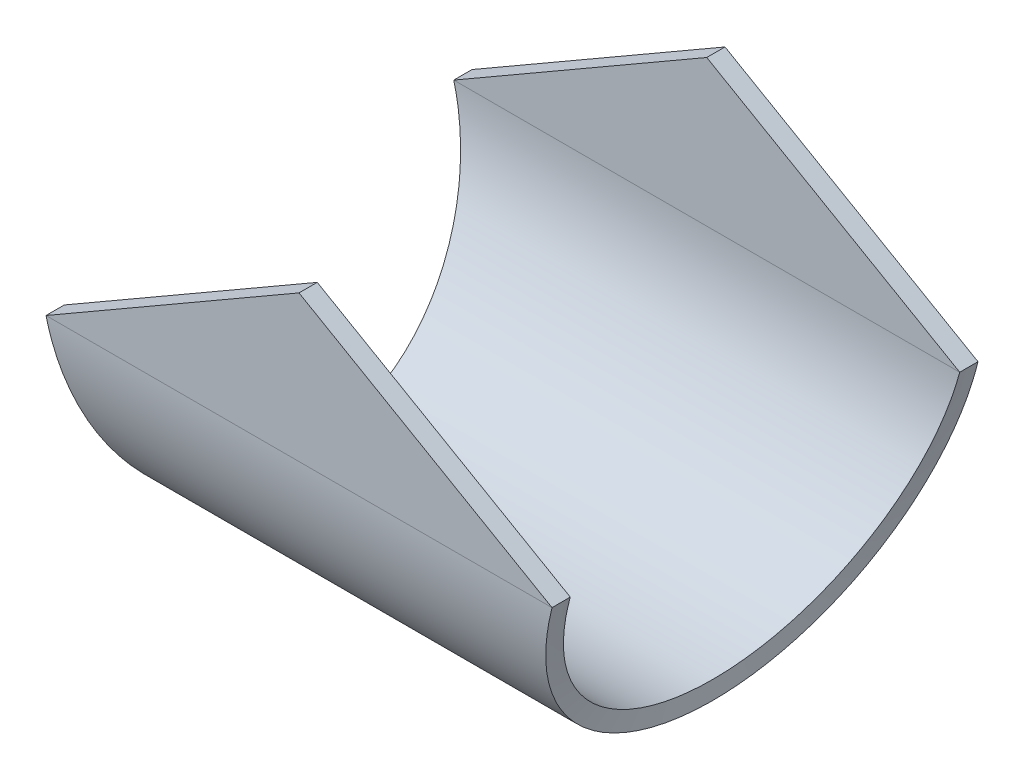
ISO-10303-21;
HEADER;
FILE_DESCRIPTION(('STEP AP214'),'2;1');
FILE_NAME('part.step','',(''),(''),'','','');
FILE_SCHEMA(('AUTOMOTIVE_DESIGN { 1 0 10303 214 1 1 1 1 }'));
ENDSEC;
DATA;
#1=APPLICATION_CONTEXT('core data for automotive mechanical design processes');
#2=APPLICATION_PROTOCOL_DEFINITION('international standard','automotive_design',2000,#1);
#3=PRODUCT_CONTEXT('',#1,'mechanical');
#4=PRODUCT('Part','Part','',(#3));
#5=PRODUCT_RELATED_PRODUCT_CATEGORY('part','',(#4));
#6=PRODUCT_DEFINITION_FORMATION('','',#4);
#7=PRODUCT_DEFINITION_CONTEXT('part definition',#1,'design');
#8=PRODUCT_DEFINITION('design','',#6,#7);
#9=PRODUCT_DEFINITION_SHAPE('','',#8);
#10=(LENGTH_UNIT() NAMED_UNIT(*) SI_UNIT(.MILLI.,.METRE.));
#11=(NAMED_UNIT(*) PLANE_ANGLE_UNIT() SI_UNIT($,.RADIAN.));
#12=(NAMED_UNIT(*) SI_UNIT($,.STERADIAN.) SOLID_ANGLE_UNIT());
#13=UNCERTAINTY_MEASURE_WITH_UNIT(LENGTH_MEASURE(1.E-05),#10,'distance_accuracy_value','');
#14=(GEOMETRIC_REPRESENTATION_CONTEXT(3) GLOBAL_UNCERTAINTY_ASSIGNED_CONTEXT((#13)) GLOBAL_UNIT_ASSIGNED_CONTEXT((#10,
#11,#12)) REPRESENTATION_CONTEXT('',''));
#15=CARTESIAN_POINT('',(0.,0.,0.));
#16=DIRECTION('',(0.,0.,1.));
#17=DIRECTION('',(1.,0.,0.));
#18=AXIS2_PLACEMENT_3D('',#15,#16,#17);
#19=CARTESIAN_POINT('',(-13.856406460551,-8.00000000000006,-47.0229908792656));
#20=DIRECTION('',(-0.500000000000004,0.866025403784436,0.));
#21=DIRECTION('',(0.866025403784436,0.500000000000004,0.));
#22=AXIS2_PLACEMENT_3D('',#19,#20,#21);
#23=PLANE('',#22);
#24=DIRECTION('',(-0.866025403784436,-0.500000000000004,0.));
#25=VECTOR('',#24,1.);
#26=CARTESIAN_POINT('',(-13.856406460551,-8.00000000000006,11.6658295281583));
#27=LINE('',#26,#25);
#28=CARTESIAN_POINT('',(0.,0.,11.6658295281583));
#29=VERTEX_POINT('',#28);
#30=CARTESIAN_POINT('',(-13.856406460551,-8.00000000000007,11.6658295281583));
#31=VERTEX_POINT('',#30);
#32=EDGE_CURVE('E287',#29,#31,#27,.T.);
#33=ORIENTED_EDGE('',*,*,#32,.F.);
#34=DIRECTION('',(0.,0.,1.));
#35=VECTOR('',#34,1.);
#36=CARTESIAN_POINT('',(0.,0.,-47.0229908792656));
#37=LINE('',#36,#35);
#38=CARTESIAN_POINT('',(0.,0.,10.6658295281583));
#39=VERTEX_POINT('',#38);
#40=EDGE_CURVE('E13',#39,#29,#37,.T.);
#41=ORIENTED_EDGE('',*,*,#40,.F.);
#42=DIRECTION('',(-0.866025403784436,-0.500000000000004,0.));
#43=VECTOR('',#42,1.);
#44=CARTESIAN_POINT('',(-13.856406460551,-8.00000000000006,10.6658295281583));
#45=LINE('',#44,#43);
#46=CARTESIAN_POINT('',(-13.856406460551,-8.00000000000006,10.6658295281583));
#47=VERTEX_POINT('',#46);
#48=EDGE_CURVE('E284',#39,#47,#45,.T.);
#49=ORIENTED_EDGE('',*,*,#48,.T.);
#50=CARTESIAN_POINT('',(-13.856406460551,-8.00000000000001,11.6658295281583));
#51=CARTESIAN_POINT('',(-13.856406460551,-8.00000000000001,10.6658295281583));
#52=B_SPLINE_CURVE_WITH_KNOTS('',1,(#50,#51),.UNSPECIFIED.,.F.,.F.,(2,2),(0.,1.),.UNSPECIFIED.);
#53=EDGE_CURVE('E293',#47,#31,#52,.F.);
#54=ORIENTED_EDGE('',*,*,#53,.T.);
#55=EDGE_LOOP('',(#33,#41,#49,#54));
#56=FACE_BOUND('',#55,.T.);
#57=ADVANCED_FACE('F37',(#56),#23,.T.);
#58=CARTESIAN_POINT('',(-13.856406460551,-8.00000000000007,11.6658295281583));
#59=DIRECTION('',(0.,0.,-1.));
#60=DIRECTION('',(0.500000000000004,-0.866025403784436,0.));
#61=AXIS2_PLACEMENT_3D('',#58,#59,#60);
#62=PLANE('',#61);
#63=DIRECTION('',(-1.,0.,0.));
#64=VECTOR('',#63,1.);
#65=CARTESIAN_POINT('',(13.856406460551,-7.99999999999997,11.6658295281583));
#66=LINE('',#65,#64);
#67=CARTESIAN_POINT('',(13.8564064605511,-7.99999999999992,11.6658295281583));
#68=VERTEX_POINT('',#67);
#69=EDGE_CURVE('E75',#68,#31,#66,.T.);
#70=ORIENTED_EDGE('',*,*,#69,.F.);
#71=DIRECTION('',(-0.86602540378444,0.499999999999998,0.));
#72=VECTOR('',#71,1.);
#73=CARTESIAN_POINT('',(0.,0.,11.6658295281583));
#74=LINE('',#73,#72);
#75=EDGE_CURVE('E289',#68,#29,#74,.T.);
#76=ORIENTED_EDGE('',*,*,#75,.T.);
#77=ORIENTED_EDGE('',*,*,#32,.T.);
#78=EDGE_LOOP('',(#70,#76,#77));
#79=FACE_BOUND('',#78,.T.);
#80=ADVANCED_FACE('F309',(#79),#62,.F.);
#81=CARTESIAN_POINT('',(0.,0.,-47.0229908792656));
#82=DIRECTION('',(0.499999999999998,0.86602540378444,0.));
#83=DIRECTION('',(0.86602540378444,-0.499999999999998,0.));
#84=AXIS2_PLACEMENT_3D('',#81,#82,#83);
#85=PLANE('',#84);
#86=ORIENTED_EDGE('',*,*,#75,.F.);
#87=CARTESIAN_POINT('',(13.8564064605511,-7.99999999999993,10.6658295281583));
#88=CARTESIAN_POINT('',(13.8564064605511,-7.99999999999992,11.6658295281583));
#89=B_SPLINE_CURVE_WITH_KNOTS('',1,(#87,#88),.UNSPECIFIED.,.F.,.F.,(2,2),(0.,1.),.UNSPECIFIED.);
#90=CARTESIAN_POINT('',(13.856406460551,-7.99999999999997,10.6658295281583));
#91=VERTEX_POINT('',#90);
#92=EDGE_CURVE('E238',#91,#68,#89,.T.);
#93=ORIENTED_EDGE('',*,*,#92,.F.);
#94=DIRECTION('',(-0.86602540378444,0.499999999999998,0.));
#95=VECTOR('',#94,1.);
#96=CARTESIAN_POINT('',(0.,0.,10.6658295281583));
#97=LINE('',#96,#95);
#98=EDGE_CURVE('E49',#91,#39,#97,.T.);
#99=ORIENTED_EDGE('',*,*,#98,.T.);
#100=ORIENTED_EDGE('',*,*,#40,.T.);
#101=EDGE_LOOP('',(#86,#93,#99,#100));
#102=FACE_BOUND('',#101,.T.);
#103=ADVANCED_FACE('F301',(#102),#85,.T.);
#104=CARTESIAN_POINT('',(-13.856406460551,-8.00000000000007,10.6658295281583));
#105=DIRECTION('',(0.,0.,-1.));
#106=DIRECTION('',(0.500000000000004,-0.866025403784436,0.));
#107=AXIS2_PLACEMENT_3D('',#104,#105,#106);
#108=PLANE('',#107);
#109=DIRECTION('',(1.,0.,0.));
#110=VECTOR('',#109,1.);
#111=CARTESIAN_POINT('',(-13.856406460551,-8.00000000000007,10.6658295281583));
#112=LINE('',#111,#110);
#113=EDGE_CURVE('E237',#47,#91,#112,.T.);
#114=ORIENTED_EDGE('',*,*,#113,.F.);
#115=ORIENTED_EDGE('',*,*,#48,.F.);
#116=ORIENTED_EDGE('',*,*,#98,.F.);
#117=EDGE_LOOP('',(#114,#115,#116));
#118=FACE_BOUND('',#117,.T.);
#119=ADVANCED_FACE('F39',(#118),#108,.T.);
#120=CARTESIAN_POINT('',(-13.856406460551,-8.00000000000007,-11.6658295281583));
#121=DIRECTION('',(0.,0.,1.));
#122=DIRECTION('',(0.500000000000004,-0.866025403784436,0.));
#123=AXIS2_PLACEMENT_3D('',#120,#121,#122);
#124=PLANE('',#123);
#125=DIRECTION('',(-1.,0.,0.));
#126=VECTOR('',#125,1.);
#127=CARTESIAN_POINT('',(13.856406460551,-7.99999999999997,-11.6658295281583));
#128=LINE('',#127,#126);
#129=CARTESIAN_POINT('',(13.856406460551,-7.99999999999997,-11.6658295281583));
#130=VERTEX_POINT('',#129);
#131=CARTESIAN_POINT('',(-13.856406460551,-8.00000000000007,-11.6658295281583));
#132=VERTEX_POINT('',#131);
#133=EDGE_CURVE('E105',#130,#132,#128,.T.);
#134=ORIENTED_EDGE('',*,*,#133,.T.);
#135=DIRECTION('',(-0.866025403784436,-0.500000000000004,0.));
#136=VECTOR('',#135,1.);
#137=CARTESIAN_POINT('',(-13.856406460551,-8.00000000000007,-11.6658295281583));
#138=LINE('',#137,#136);
#139=CARTESIAN_POINT('',(0.,0.,-11.6658295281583));
#140=VERTEX_POINT('',#139);
#141=EDGE_CURVE('E108',#140,#132,#138,.T.);
#142=ORIENTED_EDGE('',*,*,#141,.F.);
#143=DIRECTION('',(-0.86602540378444,0.499999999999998,0.));
#144=VECTOR('',#143,1.);
#145=CARTESIAN_POINT('',(0.,0.,-11.6658295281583));
#146=LINE('',#145,#144);
#147=EDGE_CURVE('E110',#130,#140,#146,.T.);
#148=ORIENTED_EDGE('',*,*,#147,.F.);
#149=EDGE_LOOP('',(#134,#142,#148));
#150=FACE_BOUND('',#149,.T.);
#151=ADVANCED_FACE('F107',(#150),#124,.F.);
#152=CARTESIAN_POINT('',(0.,0.,47.0229908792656));
#153=DIRECTION('',(-0.499999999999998,-0.86602540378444,0.));
#154=DIRECTION('',(0.86602540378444,-0.499999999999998,0.));
#155=AXIS2_PLACEMENT_3D('',#152,#153,#154);
#156=PLANE('',#155);
#157=CARTESIAN_POINT('',(13.8564064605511,-7.99999999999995,-11.6658295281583));
#158=CARTESIAN_POINT('',(13.8564064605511,-7.99999999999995,-10.6658295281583));
#159=B_SPLINE_CURVE_WITH_KNOTS('',1,(#157,#158),.UNSPECIFIED.,.F.,.F.,(2,2),(0.,1.),.UNSPECIFIED.);
#160=CARTESIAN_POINT('',(13.856406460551,-7.99999999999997,-10.6658295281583));
#161=VERTEX_POINT('',#160);
#162=EDGE_CURVE('E228',#161,#130,#159,.F.);
#163=ORIENTED_EDGE('',*,*,#162,.T.);
#164=ORIENTED_EDGE('',*,*,#147,.T.);
#165=DIRECTION('',(0.,0.,-1.));
#166=VECTOR('',#165,1.);
#167=CARTESIAN_POINT('',(0.,0.,47.0229908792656));
#168=LINE('',#167,#166);
#169=CARTESIAN_POINT('',(0.,0.,-10.6658295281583));
#170=VERTEX_POINT('',#169);
#171=EDGE_CURVE('E121',#170,#140,#168,.T.);
#172=ORIENTED_EDGE('',*,*,#171,.F.);
#173=DIRECTION('',(-0.86602540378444,0.499999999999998,0.));
#174=VECTOR('',#173,1.);
#175=CARTESIAN_POINT('',(0.,0.,-10.6658295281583));
#176=LINE('',#175,#174);
#177=EDGE_CURVE('E82',#161,#170,#176,.T.);
#178=ORIENTED_EDGE('',*,*,#177,.F.);
#179=EDGE_LOOP('',(#163,#164,#172,#178));
#180=FACE_BOUND('',#179,.T.);
#181=ADVANCED_FACE('F264',(#180),#156,.F.);
#182=CARTESIAN_POINT('',(-13.856406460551,-8.00000000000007,47.0229908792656));
#183=DIRECTION('',(0.500000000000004,-0.866025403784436,0.));
#184=DIRECTION('',(0.866025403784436,0.500000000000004,0.));
#185=AXIS2_PLACEMENT_3D('',#182,#183,#184);
#186=PLANE('',#185);
#187=ORIENTED_EDGE('',*,*,#171,.T.);
#188=ORIENTED_EDGE('',*,*,#141,.T.);
#189=CARTESIAN_POINT('',(-13.856406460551,-8.00000000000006,-10.6658295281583));
#190=CARTESIAN_POINT('',(-13.856406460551,-8.00000000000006,-11.6658295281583));
#191=B_SPLINE_CURVE_WITH_KNOTS('',1,(#189,#190),.UNSPECIFIED.,.F.,.F.,(2,2),(0.,1.),.UNSPECIFIED.);
#192=CARTESIAN_POINT('',(-13.856406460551,-8.00000000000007,-10.6658295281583));
#193=VERTEX_POINT('',#192);
#194=EDGE_CURVE('E119',#193,#132,#191,.T.);
#195=ORIENTED_EDGE('',*,*,#194,.F.);
#196=DIRECTION('',(-0.866025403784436,-0.500000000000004,0.));
#197=VECTOR('',#196,1.);
#198=CARTESIAN_POINT('',(-13.856406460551,-8.00000000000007,-10.6658295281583));
#199=LINE('',#198,#197);
#200=EDGE_CURVE('E90',#170,#193,#199,.T.);
#201=ORIENTED_EDGE('',*,*,#200,.F.);
#202=EDGE_LOOP('',(#187,#188,#195,#201));
#203=FACE_BOUND('',#202,.T.);
#204=ADVANCED_FACE('F118',(#203),#186,.F.);
#205=CARTESIAN_POINT('',(-13.856406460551,-8.00000000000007,-10.6658295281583));
#206=DIRECTION('',(0.,0.,1.));
#207=DIRECTION('',(0.500000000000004,-0.866025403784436,0.));
#208=AXIS2_PLACEMENT_3D('',#205,#206,#207);
#209=PLANE('',#208);
#210=DIRECTION('',(1.,0.,0.));
#211=VECTOR('',#210,1.);
#212=CARTESIAN_POINT('',(-13.856406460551,-8.00000000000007,-10.6658295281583));
#213=LINE('',#212,#211);
#214=EDGE_CURVE('E280',#161,#193,#213,.F.);
#215=ORIENTED_EDGE('',*,*,#214,.F.);
#216=ORIENTED_EDGE('',*,*,#177,.T.);
#217=ORIENTED_EDGE('',*,*,#200,.T.);
#218=EDGE_LOOP('',(#215,#216,#217));
#219=FACE_BOUND('',#218,.T.);
#220=ADVANCED_FACE('F202',(#219),#209,.T.);
#221=CARTESIAN_POINT('',(13.8564064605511,-7.99999999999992,11.6658295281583));
#222=CARTESIAN_POINT('',(13.7358018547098,-8.4923131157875,11.6658295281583));
#223=CARTESIAN_POINT('',(13.6298455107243,-8.92562892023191,11.6351073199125));
#224=CARTESIAN_POINT('',(13.4927498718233,-9.48524358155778,11.5724182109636));
#225=CARTESIAN_POINT('',(13.4506985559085,-9.65675907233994,11.5486732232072));
#226=CARTESIAN_POINT('',(13.3930924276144,-9.89163335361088,11.5117150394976));
#227=CARTESIAN_POINT('',(13.374802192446,-9.96619374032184,11.4991668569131));
#228=CARTESIAN_POINT('',(13.3487345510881,-10.0724693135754,11.4803198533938));
#229=CARTESIAN_POINT('',(13.3402732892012,-10.1069670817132,11.4740330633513));
#230=CARTESIAN_POINT('',(13.3279233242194,-10.1573271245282,11.4646330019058));
#231=CARTESIAN_POINT('',(13.3238636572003,-10.1738827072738,11.4615046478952));
#232=CARTESIAN_POINT('',(13.3178596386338,-10.198370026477,11.4568240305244));
#233=CARTESIAN_POINT('',(13.3158725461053,-10.2064747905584,11.455265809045));
#234=CARTESIAN_POINT('',(13.3129132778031,-10.2185454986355,11.4529319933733));
#235=CARTESIAN_POINT('',(13.3119304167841,-10.2225546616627,11.4521546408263));
#236=CARTESIAN_POINT('',(13.3104614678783,-10.2285468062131,11.4509895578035));
#237=CARTESIAN_POINT('',(13.3099727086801,-10.2305405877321,11.4506013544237));
#238=CARTESIAN_POINT('',(13.3092409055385,-10.2335258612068,11.4500192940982));
#239=CARTESIAN_POINT('',(13.3089971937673,-10.2345200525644,11.44982531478));
#240=CARTESIAN_POINT('',(13.3085102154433,-10.2365066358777,11.4494374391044));
#241=CARTESIAN_POINT('',(13.3084106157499,-10.2369129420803,11.4493581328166));
#242=CARTESIAN_POINT('',(13.2090259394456,-10.6423505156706,11.3700879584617));
#243=CARTESIAN_POINT('',(13.1154216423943,-11.0246935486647,11.2731735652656));
#244=CARTESIAN_POINT('',(12.9831056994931,-11.564924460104,11.1093789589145));
#245=CARTESIAN_POINT('',(12.9403488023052,-11.7394699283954,11.0517021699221));
#246=CARTESIAN_POINT('',(12.8782360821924,-11.9929907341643,10.9615531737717));
#247=CARTESIAN_POINT('',(12.8578689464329,-12.0761155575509,10.9308972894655));
#248=CARTESIAN_POINT('',(12.827823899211,-12.1987362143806,10.8841217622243));
#249=CARTESIAN_POINT('',(12.8178931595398,-12.2392653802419,10.8683979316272));
#250=CARTESIAN_POINT('',(12.8031234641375,-12.29954374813,10.8446285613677));
#251=CARTESIAN_POINT('',(12.7982213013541,-12.3195506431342,10.8366748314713));
#252=CARTESIAN_POINT('',(12.790899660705,-12.3494323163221,10.8247000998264));
#253=CARTESIAN_POINT('',(12.7884643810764,-12.3593714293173,10.820701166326));
#254=CARTESIAN_POINT('',(12.7848193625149,-12.3742479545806,10.8146919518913));
#255=CARTESIAN_POINT('',(12.7836056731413,-12.3792014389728,10.8126870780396));
#256=CARTESIAN_POINT('',(12.7817871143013,-12.3866236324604,10.8096770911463));
#257=CARTESIAN_POINT('',(12.7811812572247,-12.3890963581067,10.808673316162));
#258=CARTESIAN_POINT('',(12.7799702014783,-12.3940391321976,10.8066648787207));
#259=CARTESIAN_POINT('',(12.7794984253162,-12.3959646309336,10.8058819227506));
#260=CARTESIAN_POINT('',(12.5897573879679,-13.1703724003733,10.4905916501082));
#261=CARTESIAN_POINT('',(12.4181248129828,-13.8728985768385,10.108207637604));
#262=CARTESIAN_POINT('',(12.1867312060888,-14.8174223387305,9.47407707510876));
#263=CARTESIAN_POINT('',(12.1139425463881,-15.1141952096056,9.25255863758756));
#264=CARTESIAN_POINT('',(12.011273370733,-15.5326111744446,8.90976186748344));
#265=CARTESIAN_POINT('',(11.9781359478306,-15.667632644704,8.79373874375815));
#266=CARTESIAN_POINT('',(11.930058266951,-15.8635889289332,8.61761341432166));
#267=CARTESIAN_POINT('',(11.9143037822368,-15.9278120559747,8.55855623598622));
#268=CARTESIAN_POINT('',(11.891079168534,-16.0225187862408,8.46951288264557));
#269=CARTESIAN_POINT('',(11.8834054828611,-16.0538163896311,8.43975548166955));
#270=CARTESIAN_POINT('',(11.871996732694,-16.1003579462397,8.39501297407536));
#271=CARTESIAN_POINT('',(11.8682107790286,-16.1158043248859,8.38008106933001));
#272=CARTESIAN_POINT('',(11.8625572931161,-16.1388729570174,8.35765760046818));
#273=CARTESIAN_POINT('',(11.8606770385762,-16.146545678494,8.35017884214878));
#274=CARTESIAN_POINT('',(11.8578630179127,-16.1580295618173,8.3389544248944));
#275=CARTESIAN_POINT('',(11.8569260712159,-16.1618533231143,8.33521190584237));
#276=CARTESIAN_POINT('',(11.8550542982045,-16.1694924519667,8.32772479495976));
#277=CARTESIAN_POINT('',(11.8542813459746,-16.1726471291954,8.32462952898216));
#278=CARTESIAN_POINT('',(11.7129437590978,-16.7495175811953,7.75768177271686));
#279=CARTESIAN_POINT('',(11.5903002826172,-17.2512289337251,7.14818810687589));
#280=CARTESIAN_POINT('',(11.432732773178,-17.8943921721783,6.19194193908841));
#281=CARTESIAN_POINT('',(11.3846098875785,-18.0906228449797,5.86617086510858));
#282=CARTESIAN_POINT('',(11.3190249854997,-18.3579403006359,5.37028064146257));
#283=CARTESIAN_POINT('',(11.2982632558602,-18.4425453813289,5.20377624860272));
#284=CARTESIAN_POINT('',(11.268770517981,-18.5627619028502,4.95260085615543));
#285=CARTESIAN_POINT('',(11.2592145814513,-18.6017191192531,4.868639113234));
#286=CARTESIAN_POINT('',(11.2452931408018,-18.6584919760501,4.74238932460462));
#287=CARTESIAN_POINT('',(11.2407214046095,-18.6771391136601,4.70025485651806));
#288=CARTESIAN_POINT('',(11.2339669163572,-18.7046953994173,4.63698222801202));
#289=CARTESIAN_POINT('',(11.2317326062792,-18.7138117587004,4.61587953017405));
#290=CARTESIAN_POINT('',(11.2284069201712,-18.7273828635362,4.58420848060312));
#291=CARTESIAN_POINT('',(11.2273026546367,-18.731889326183,4.57364863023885));
#292=CARTESIAN_POINT('',(11.2251027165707,-18.7408678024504,4.55252338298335));
#293=CARTESIAN_POINT('',(11.2240844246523,-18.745023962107,4.5427072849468));
#294=CARTESIAN_POINT('',(11.1481152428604,-19.0551167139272,3.80707572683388));
#295=CARTESIAN_POINT('',(11.0920142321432,-19.2849294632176,3.05671947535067));
#296=CARTESIAN_POINT('',(11.0172110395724,-19.5902721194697,1.53582523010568));
#297=CARTESIAN_POINT('',(10.9985088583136,-19.6658214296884,0.765494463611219));
#298=CARTESIAN_POINT('',(10.9985033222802,-19.6658376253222,-0.765247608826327));
#299=CARTESIAN_POINT('',(11.0172006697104,-19.5902721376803,-1.53582592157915));
#300=CARTESIAN_POINT('',(11.0732968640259,-19.3612644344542,-2.67649897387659));
#301=CARTESIAN_POINT('',(11.0966706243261,-19.2656993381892,-3.05417569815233));
#302=CARTESIAN_POINT('',(11.138743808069,-19.0936662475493,-3.61389620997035));
#303=CARTESIAN_POINT('',(11.1539369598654,-19.0315441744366,-3.7993368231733));
#304=CARTESIAN_POINT('',(11.1784798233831,-18.9312435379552,-4.07542395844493));
#305=CARTESIAN_POINT('',(11.1869529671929,-18.8966239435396,-4.16710736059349));
#306=CARTESIAN_POINT('',(11.2001009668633,-18.8429234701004,-4.30406712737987));
#307=CARTESIAN_POINT('',(11.204556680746,-18.8247281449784,-4.34962616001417));
#308=CARTESIAN_POINT('',(11.2113498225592,-18.796993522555,-4.41781751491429));
#309=CARTESIAN_POINT('',(11.213632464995,-18.7876750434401,-4.44052343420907));
#310=CARTESIAN_POINT('',(11.2170838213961,-18.7735870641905,-4.47454478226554));
#311=CARTESIAN_POINT('',(11.2182388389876,-18.7688726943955,-4.48587897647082));
#312=CARTESIAN_POINT('',(11.2205580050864,-18.7594072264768,-4.50853473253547));
#313=CARTESIAN_POINT('',(11.2217997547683,-18.7543394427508,-4.52060760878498));
#314=CARTESIAN_POINT('',(11.2927220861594,-18.4649097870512,-5.20725917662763));
#315=CARTESIAN_POINT('',(11.3801584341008,-18.1091260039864,-5.8725977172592));
#316=CARTESIAN_POINT('',(11.5377206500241,-17.4660175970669,-6.82888372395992));
#317=CARTESIAN_POINT('',(11.5946426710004,-17.2334672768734,-7.14065416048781));
#318=CARTESIAN_POINT('',(11.6866276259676,-16.8575551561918,-7.59433114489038));
#319=CARTESIAN_POINT('',(11.7183895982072,-16.7277411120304,-7.7432252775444));
#320=CARTESIAN_POINT('',(11.7676830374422,-16.526319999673,-7.96261903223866));
#321=CARTESIAN_POINT('',(11.7843892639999,-16.458063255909,-8.0350922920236));
#322=CARTESIAN_POINT('',(11.8098612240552,-16.3540144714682,-8.14275823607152));
#323=CARTESIAN_POINT('',(11.8184206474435,-16.3190542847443,-8.17847288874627));
#324=CARTESIAN_POINT('',(11.8313629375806,-16.2661996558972,-8.23177671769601));
#325=CARTESIAN_POINT('',(11.8356942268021,-16.2485123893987,-8.24949996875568));
#326=CARTESIAN_POINT('',(11.8422169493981,-16.2218781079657,-8.27601691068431));
#327=CARTESIAN_POINT('',(11.8443954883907,-16.2129827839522,-8.28484456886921));
#328=CARTESIAN_POINT('',(11.8476697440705,-16.1996139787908,-8.29806896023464));
#329=CARTESIAN_POINT('',(11.8487622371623,-16.1951534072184,-8.30247424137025));
#330=CARTESIAN_POINT('',(11.8509493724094,-16.1862236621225,-8.31127908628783));
#331=CARTESIAN_POINT('',(11.8522077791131,-16.1810858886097,-8.31633577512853));
#332=CARTESIAN_POINT('',(11.9724296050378,-15.6902573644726,-8.7987403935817));
#333=CARTESIAN_POINT('',(12.1092047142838,-15.133766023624,-9.26154524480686));
#334=CARTESIAN_POINT('',(12.3405952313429,-14.1893119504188,-9.89584817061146));
#335=CARTESIAN_POINT('',(12.422096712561,-13.8562982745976,-10.0972200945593));
#336=CARTESIAN_POINT('',(12.5509058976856,-13.3297901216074,-10.3790434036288));
#337=CARTESIAN_POINT('',(12.5949351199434,-13.1497973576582,-10.4696081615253));
#338=CARTESIAN_POINT('',(12.6626181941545,-12.8731881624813,-10.5997168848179));
#339=CARTESIAN_POINT('',(12.6854524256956,-12.7798823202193,-10.6421298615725));
#340=CARTESIAN_POINT('',(12.7201135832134,-12.6382890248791,-10.7042285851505));
#341=CARTESIAN_POINT('',(12.731735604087,-12.5908188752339,-10.7246746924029));
#342=CARTESIAN_POINT('',(12.7492710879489,-12.5192078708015,-10.7549528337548));
#343=CARTESIAN_POINT('',(12.7551333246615,-12.4952699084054,-10.7649803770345));
#344=CARTESIAN_POINT('',(12.7639522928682,-12.4592618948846,-10.77992257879));
#345=CARTESIAN_POINT('',(12.7668962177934,-12.4472423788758,-10.7848867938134));
#346=CARTESIAN_POINT('',(12.7713185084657,-12.4291878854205,-10.792308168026));
#347=CARTESIAN_POINT('',(12.7727936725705,-12.4231655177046,-10.7947778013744));
#348=CARTESIAN_POINT('',(12.7750080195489,-12.4141256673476,-10.7984759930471));
#349=CARTESIAN_POINT('',(12.7757464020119,-12.4111113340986,-10.7997076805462));
#350=CARTESIAN_POINT('',(12.7772237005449,-12.4050805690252,-10.8021689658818));
#351=CARTESIAN_POINT('',(12.7781005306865,-12.4015011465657,-10.8036277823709));
#352=CARTESIAN_POINT('',(12.8556642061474,-12.0848719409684,-10.9325416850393));
#353=CARTESIAN_POINT('',(12.9382558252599,-11.747857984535,-11.0538130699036));
#354=CARTESIAN_POINT('',(13.0705870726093,-11.2076510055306,-11.2177522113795));
#355=CARTESIAN_POINT('',(13.1161047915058,-11.021812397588,-11.2693930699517));
#356=CARTESIAN_POINT('',(13.1864923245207,-10.7344666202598,-11.341252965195));
#357=CARTESIAN_POINT('',(13.2103066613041,-10.6372543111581,-11.3642720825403));
#358=CARTESIAN_POINT('',(13.2465559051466,-10.4893075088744,-11.397257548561));
#359=CARTESIAN_POINT('',(13.2587269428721,-10.4396372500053,-11.4079954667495));
#360=CARTESIAN_POINT('',(13.2771154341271,-10.3646026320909,-11.4236984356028));
#361=CARTESIAN_POINT('',(13.2832669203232,-10.3395028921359,-11.4288654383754));
#362=CARTESIAN_POINT('',(13.2925271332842,-10.3017213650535,-11.4365126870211));
#363=CARTESIAN_POINT('',(13.2956193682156,-10.2891055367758,-11.4390445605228));
#364=CARTESIAN_POINT('',(13.3002659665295,-10.2701488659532,-11.4428162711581));
#365=CARTESIAN_POINT('',(13.3018162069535,-10.2638244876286,-11.4440691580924));
#366=CARTESIAN_POINT('',(13.3041436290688,-10.2543296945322,-11.4459419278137));
#367=CARTESIAN_POINT('',(13.3049197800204,-10.2511633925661,-11.4465650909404));
#368=CARTESIAN_POINT('',(13.3060845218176,-10.2464118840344,-11.4474981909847));
#369=CARTESIAN_POINT('',(13.3064728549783,-10.2448277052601,-11.4478089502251));
#370=CARTESIAN_POINT('',(13.3072496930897,-10.2416586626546,-11.4484299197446));
#371=CARTESIAN_POINT('',(13.3077831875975,-10.2394823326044,-11.4488557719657));
#372=CARTESIAN_POINT('',(13.3703887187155,-9.98409113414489,-11.4987891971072));
#373=CARTESIAN_POINT('',(13.4472679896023,-9.67090917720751,-11.5516480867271));
#374=CARTESIAN_POINT('',(13.6300612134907,-8.92475063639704,-11.635177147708));
#375=CARTESIAN_POINT('',(13.7359456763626,-8.49172542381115,-11.6658295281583));
#376=CARTESIAN_POINT('',(13.8564064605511,-7.99999999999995,-11.6658295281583));
#377=CARTESIAN_POINT('',(13.8564064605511,-7.99999999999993,10.6658295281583));
#378=CARTESIAN_POINT('',(13.7358021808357,-8.4501106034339,10.6658295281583));
#379=CARTESIAN_POINT('',(13.6298455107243,-8.84628360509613,10.6377408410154));
#380=CARTESIAN_POINT('',(13.4927498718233,-9.35792785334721,10.5804254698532));
#381=CARTESIAN_POINT('',(13.4506985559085,-9.51474096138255,10.5587159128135));
#382=CARTESIAN_POINT('',(13.3930924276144,-9.72948171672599,10.524925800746));
#383=CARTESIAN_POINT('',(13.374802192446,-9.79765075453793,10.5134532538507));
#384=CARTESIAN_POINT('',(13.3487345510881,-9.89481633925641,10.4962218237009));
#385=CARTESIAN_POINT('',(13.3402732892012,-9.92635694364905,10.4904739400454));
#386=CARTESIAN_POINT('',(13.3279233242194,-9.97240010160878,10.4818796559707));
#387=CARTESIAN_POINT('',(13.3238636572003,-9.9875365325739,10.4790194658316));
#388=CARTESIAN_POINT('',(13.3178596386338,-10.0099247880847,10.4747400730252));
#389=CARTESIAN_POINT('',(13.3158725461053,-10.0173348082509,10.4733154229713));
#390=CARTESIAN_POINT('',(13.3129132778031,-10.028370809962,10.4711816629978));
#391=CARTESIAN_POINT('',(13.3119304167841,-10.0320363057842,10.4704709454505));
#392=CARTESIAN_POINT('',(13.3104614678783,-10.0375148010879,10.469405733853));
#393=CARTESIAN_POINT('',(13.3099727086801,-10.0393376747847,10.4690508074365));
#394=CARTESIAN_POINT('',(13.3092409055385,-10.0420670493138,10.4685186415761));
#395=CARTESIAN_POINT('',(13.3089971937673,-10.0429760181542,10.4683412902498));
#396=CARTESIAN_POINT('',(13.3085102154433,-10.0447923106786,10.4679866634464));
#397=CARTESIAN_POINT('',(13.3084106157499,-10.0451637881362,10.4679141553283));
#398=CARTESIAN_POINT('',(13.2090259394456,-10.4158470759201,10.3954390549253));
#399=CARTESIAN_POINT('',(13.1154216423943,-10.7654154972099,10.306832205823));
#400=CARTESIAN_POINT('',(12.9831056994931,-11.2593375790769,10.1570781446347));
#401=CARTESIAN_POINT('',(12.9403488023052,-11.4189209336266,10.1043454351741));
#402=CARTESIAN_POINT('',(12.8782360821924,-11.6507098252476,10.0219240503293));
#403=CARTESIAN_POINT('',(12.8578689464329,-11.7267091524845,9.99389600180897));
#404=CARTESIAN_POINT('',(12.827823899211,-11.8388187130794,9.95113009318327));
#405=CARTESIAN_POINT('',(12.8178931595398,-11.8758737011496,9.93675411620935));
#406=CARTESIAN_POINT('',(12.8031234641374,-11.9309849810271,9.91502226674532));
#407=CARTESIAN_POINT('',(12.7982213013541,-11.9492768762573,9.90775033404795));
#408=CARTESIAN_POINT('',(12.790899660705,-11.9765970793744,9.89680208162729));
#409=CARTESIAN_POINT('',(12.7884643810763,-11.9856842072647,9.89314593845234));
#410=CARTESIAN_POINT('',(12.7848193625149,-11.9992855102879,9.88765183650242));
#411=CARTESIAN_POINT('',(12.7836056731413,-12.0038143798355,9.88581882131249));
#412=CARTESIAN_POINT('',(12.7817871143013,-12.010600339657,9.88306685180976));
#413=CARTESIAN_POINT('',(12.7811812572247,-12.0128611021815,9.88214912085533));
#414=CARTESIAN_POINT('',(12.7799702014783,-12.0173801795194,9.88031284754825));
#415=CARTESIAN_POINT('',(12.7794984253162,-12.0191406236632,9.87959700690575));
#416=CARTESIAN_POINT('',(12.5897573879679,-12.7271658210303,9.59133355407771));
#417=CARTESIAN_POINT('',(12.4181248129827,-13.3694711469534,9.24172766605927));
#418=CARTESIAN_POINT('',(12.1867312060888,-14.2330299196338,8.66195505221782));
#419=CARTESIAN_POINT('',(12.1139425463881,-14.504363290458,8.45942527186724));
#420=CARTESIAN_POINT('',(12.011273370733,-14.8869124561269,8.14601319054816));
#421=CARTESIAN_POINT('',(11.9781359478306,-15.0103598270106,8.03993561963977));
#422=CARTESIAN_POINT('',(11.930058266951,-15.1895186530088,7.87890783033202));
#423=CARTESIAN_POINT('',(11.9143037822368,-15.248236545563,7.82491305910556));
#424=CARTESIAN_POINT('',(11.891079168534,-15.3348249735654,7.74350254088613));
#425=CARTESIAN_POINT('',(11.8834054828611,-15.3634397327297,7.7162959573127));
#426=CARTESIAN_POINT('',(11.871996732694,-15.4059917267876,7.67538879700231));
#427=CARTESIAN_POINT('',(11.8682107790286,-15.420114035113,7.66173686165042));
#428=CARTESIAN_POINT('',(11.8625572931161,-15.4412052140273,7.64123554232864));
#429=CARTESIAN_POINT('',(11.8606770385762,-15.4482202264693,7.63439786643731));
#430=CARTESIAN_POINT('',(11.8578630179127,-15.4587197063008,7.62413561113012));
#431=CARTESIAN_POINT('',(11.8569260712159,-15.4622156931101,7.62071390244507));
#432=CARTESIAN_POINT('',(11.8550542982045,-15.4691999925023,7.61386858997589));
#433=CARTESIAN_POINT('',(11.8542813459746,-15.4720842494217,7.61103865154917));
#434=CARTESIAN_POINT('',(11.7129437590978,-15.999505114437,7.09268990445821));
#435=CARTESIAN_POINT('',(11.5903002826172,-16.4582095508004,6.5354423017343));
#436=CARTESIAN_POINT('',(11.432732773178,-17.0462405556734,5.66116597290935));
#437=CARTESIAN_POINT('',(11.3846098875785,-17.2256502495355,5.36332013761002));
#438=CARTESIAN_POINT('',(11.3190249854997,-17.4700531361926,4.90993784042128));
#439=CARTESIAN_POINT('',(11.2982632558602,-17.5474058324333,4.7577062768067));
#440=CARTESIAN_POINT('',(11.268770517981,-17.6573173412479,4.52806174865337));
#441=CARTESIAN_POINT('',(11.2592145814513,-17.6929351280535,4.4512972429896));
#442=CARTESIAN_POINT('',(11.2452931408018,-17.7448413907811,4.33586964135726));
#443=CARTESIAN_POINT('',(11.2407214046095,-17.7618900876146,4.29734695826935));
#444=CARTESIAN_POINT('',(11.2339669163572,-17.7870842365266,4.2394980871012));
#445=CARTESIAN_POINT('',(11.2317326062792,-17.7954191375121,4.22020432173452));
#446=CARTESIAN_POINT('',(11.2284069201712,-17.8078269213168,4.19124812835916));
#447=CARTESIAN_POINT('',(11.2273026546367,-17.8119470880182,4.18159347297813));
#448=CARTESIAN_POINT('',(11.2251027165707,-17.8201559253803,4.16227909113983));
#449=CARTESIAN_POINT('',(11.2240844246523,-17.8239558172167,4.1533044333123));
#450=CARTESIAN_POINT('',(11.1481152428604,-18.1074672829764,3.48073153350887));
#451=CARTESIAN_POINT('',(11.0920142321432,-18.3175803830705,2.79469614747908));
#452=CARTESIAN_POINT('',(11.0172110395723,-18.5967489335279,1.40417362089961));
#453=CARTESIAN_POINT('',(10.9985088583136,-18.6658221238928,0.699875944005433));
#454=CARTESIAN_POINT('',(10.9985033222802,-18.6658369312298,-0.699650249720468));
#455=CARTESIAN_POINT('',(11.0172006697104,-18.5967489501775,-1.40417425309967));
#456=CARTESIAN_POINT('',(11.0732968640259,-18.3873718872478,-2.44706831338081));
#457=CARTESIAN_POINT('',(11.0966706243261,-18.2999986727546,-2.7923704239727));
#458=CARTESIAN_POINT('',(11.138743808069,-18.1427123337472,-3.30411144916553));
#459=CARTESIAN_POINT('',(11.1539369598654,-18.0859153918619,-3.47365601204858));
#460=CARTESIAN_POINT('',(11.1784798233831,-17.994212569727,-3.72607683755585));
#461=CARTESIAN_POINT('',(11.1869529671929,-17.9625605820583,-3.80990109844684));
#462=CARTESIAN_POINT('',(11.2001009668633,-17.9134633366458,-3.93512061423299));
#463=CARTESIAN_POINT('',(11.204556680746,-17.8968277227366,-3.97677430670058));
#464=CARTESIAN_POINT('',(11.2113498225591,-17.8714705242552,-4.03912026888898));
#465=CARTESIAN_POINT('',(11.213632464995,-17.8629508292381,-4.0598798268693));
#466=CARTESIAN_POINT('',(11.2170838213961,-17.85007047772,-4.09098485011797));
#467=CARTESIAN_POINT('',(11.2182388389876,-17.845760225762,-4.10134747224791));
#468=CARTESIAN_POINT('',(11.2205580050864,-17.8371061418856,-4.12206116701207));
#469=CARTESIAN_POINT('',(11.2217997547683,-17.832472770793,-4.13309915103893));
#470=CARTESIAN_POINT('',(11.2927220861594,-17.5678531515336,-4.76089064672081));
#471=CARTESIAN_POINT('',(11.3801584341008,-17.2425673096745,-5.36919607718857));
#472=CARTESIAN_POINT('',(11.5377206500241,-16.6545864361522,-6.24350882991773));
#473=CARTESIAN_POINT('',(11.5946426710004,-16.441970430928,-6.52855416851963));
#474=CARTESIAN_POINT('',(11.6866276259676,-16.0982816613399,-6.94334176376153));
#475=CARTESIAN_POINT('',(11.7183895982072,-15.9795953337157,-7.07947262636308));
#476=CARTESIAN_POINT('',(11.7676830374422,-15.7954401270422,-7.28005985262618));
#477=CARTESIAN_POINT('',(11.7843892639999,-15.7330343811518,-7.34632067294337));
#478=CARTESIAN_POINT('',(11.8098612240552,-15.637904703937,-7.44475744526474));
#479=CARTESIAN_POINT('',(11.8184206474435,-15.6059413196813,-7.47741062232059));
#480=CARTESIAN_POINT('',(11.8313629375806,-15.5576174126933,-7.52614522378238));
#481=CARTESIAN_POINT('',(11.8356942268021,-15.5414463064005,-7.54234923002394));
#482=CARTESIAN_POINT('',(11.8422169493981,-15.5170951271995,-7.56659312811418));
#483=CARTESIAN_POINT('',(11.8443954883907,-15.5089623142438,-7.57466407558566));
#484=CARTESIAN_POINT('',(11.8476697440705,-15.4967394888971,-7.58675486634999));
#485=CARTESIAN_POINT('',(11.8487622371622,-15.4926612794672,-7.59078252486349));
#486=CARTESIAN_POINT('',(11.8509493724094,-15.4844969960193,-7.59883261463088));
#487=CARTESIAN_POINT('',(11.8522077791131,-15.479799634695,-7.6034558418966));
#488=CARTESIAN_POINT('',(11.9724296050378,-15.0310451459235,-8.04450852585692));
#489=CARTESIAN_POINT('',(12.1092047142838,-14.5222564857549,-8.46764154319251));
#490=CARTESIAN_POINT('',(12.3405952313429,-13.6587614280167,-9.04757174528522));
#491=CARTESIAN_POINT('',(12.422096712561,-13.3542938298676,-9.23168198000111));
#492=CARTESIAN_POINT('',(12.5509058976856,-12.8729181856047,-9.48934727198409));
#493=CARTESIAN_POINT('',(12.5949351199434,-12.708354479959,-9.57214877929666));
#494=CARTESIAN_POINT('',(12.6626181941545,-12.4554563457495,-9.69110452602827));
#495=CARTESIAN_POINT('',(12.6854524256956,-12.3701487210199,-9.7298818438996));
#496=CARTESIAN_POINT('',(12.7201135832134,-12.2406928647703,-9.7866574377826));
#497=CARTESIAN_POINT('',(12.731735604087,-12.1972918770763,-9.80535089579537));
#498=CARTESIAN_POINT('',(12.7492710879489,-12.1318193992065,-9.83303358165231));
#499=CARTESIAN_POINT('',(12.7551333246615,-12.1099334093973,-9.84220155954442));
#500=CARTESIAN_POINT('',(12.7639522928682,-12.0770120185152,-9.85586290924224));
#501=CARTESIAN_POINT('',(12.7668962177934,-12.066022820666,-9.8604015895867));
#502=CARTESIAN_POINT('',(12.7713185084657,-12.0495159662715,-9.86718680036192));
#503=CARTESIAN_POINT('',(12.7727936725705,-12.0440098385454,-9.86944473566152));
#504=CARTESIAN_POINT('',(12.7750080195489,-12.0357448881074,-9.87282591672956));
#505=CARTESIAN_POINT('',(12.7757464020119,-12.0329889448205,-9.87395202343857));
#506=CARTESIAN_POINT('',(12.7772237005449,-12.0274751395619,-9.87620232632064));
#507=CARTESIAN_POINT('',(12.7781005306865,-12.0242025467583,-9.87753609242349));
#508=CARTESIAN_POINT('',(12.8556642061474,-11.7347149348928,-9.99539943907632));
#509=CARTESIAN_POINT('',(12.9382558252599,-11.426589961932,-10.1062753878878));
#510=CARTESIAN_POINT('',(13.0705870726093,-10.9326897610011,-10.2561615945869));
#511=CARTESIAN_POINT('',(13.1161047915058,-10.7627813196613,-10.3033757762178));
#512=CARTESIAN_POINT('',(13.1864923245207,-10.5000669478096,-10.3690758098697));
#513=CARTESIAN_POINT('',(13.2103066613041,-10.4111877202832,-10.3901217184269));
#514=CARTESIAN_POINT('',(13.2465559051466,-10.2759229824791,-10.4202796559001));
#515=CARTESIAN_POINT('',(13.2587269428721,-10.2305104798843,-10.4300971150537));
#516=CARTESIAN_POINT('',(13.2771154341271,-10.1619078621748,-10.4444540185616));
#517=CARTESIAN_POINT('',(13.2832669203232,-10.1389596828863,-10.4491781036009));
#518=CARTESIAN_POINT('',(13.2925271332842,-10.1044168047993,-10.4561698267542));
#519=CARTESIAN_POINT('',(13.2956193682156,-10.0928824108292,-10.458484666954));
#520=CARTESIAN_POINT('',(13.3002659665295,-10.0755507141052,-10.461933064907));
#521=CARTESIAN_POINT('',(13.3018162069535,-10.0697684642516,-10.4630785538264));
#522=CARTESIAN_POINT('',(13.3041436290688,-10.0610875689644,-10.4647907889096));
#523=CARTESIAN_POINT('',(13.3049197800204,-10.0581926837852,-10.465360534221));
#524=CARTESIAN_POINT('',(13.3060845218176,-10.0538484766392,-10.4662136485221));
#525=CARTESIAN_POINT('',(13.3064728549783,-10.052400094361,-10.4664977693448));
#526=CARTESIAN_POINT('',(13.3072496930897,-10.0495027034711,-10.467065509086));
#527=CARTESIAN_POINT('',(13.3077831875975,-10.0475129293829,-10.4674548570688));
#528=CARTESIAN_POINT('',(13.3703887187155,-9.81401397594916,-10.5131079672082));
#529=CARTESIAN_POINT('',(13.4472679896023,-9.52767811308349,-10.5614357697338));
#530=CARTESIAN_POINT('',(13.6300612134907,-8.84548060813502,-10.6378046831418));
#531=CARTESIAN_POINT('',(13.7359460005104,-8.4495732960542,-10.6658295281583));
#532=CARTESIAN_POINT('',(13.8564064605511,-7.99999999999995,-10.6658295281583));
#533=B_SPLINE_SURFACE_WITH_KNOTS('',1,3,((#221,#222,#223,#224,#225,#226,#227,#228,#229,#230,
#231,#232,#233,#234,#235,#236,#237,#238,#239,#240,#241,#242,#243,#244,#245,#246,#247,#248,#249,
#250,#251,#252,#253,#254,#255,#256,#257,#258,#259,#260,#261,#262,#263,#264,#265,#266,#267,#268,
#269,#270,#271,#272,#273,#274,#275,#276,#277,#278,#279,#280,#281,#282,#283,#284,#285,#286,#287,
#288,#289,#290,#291,#292,#293,#294,#295,#296,#297,#298,#299,#300,#301,#302,#303,#304,#305,#306,
#307,#308,#309,#310,#311,#312,#313,#314,#315,#316,#317,#318,#319,#320,#321,#322,#323,#324,#325,
#326,#327,#328,#329,#330,#331,#332,#333,#334,#335,#336,#337,#338,#339,#340,#341,#342,#343,#344,
#345,#346,#347,#348,#349,#350,#351,#352,#353,#354,#355,#356,#357,#358,#359,#360,#361,#362,#363,
#364,#365,#366,#367,#368,#369,#370,#371,#372,#373,#374,#375,#376),(#377,#378,#379,#380,#381,
#382,#383,#384,#385,#386,#387,#388,#389,#390,#391,#392,#393,#394,#395,#396,#397,#398,#399,#400,
#401,#402,#403,#404,#405,#406,#407,#408,#409,#410,#411,#412,#413,#414,#415,#416,#417,#418,#419,
#420,#421,#422,#423,#424,#425,#426,#427,#428,#429,#430,#431,#432,#433,#434,#435,#436,#437,#438,
#439,#440,#441,#442,#443,#444,#445,#446,#447,#448,#449,#450,#451,#452,#453,#454,#455,#456,#457,
#458,#459,#460,#461,#462,#463,#464,#465,#466,#467,#468,#469,#470,#471,#472,#473,#474,#475,#476,
#477,#478,#479,#480,#481,#482,#483,#484,#485,#486,#487,#488,#489,#490,#491,#492,#493,#494,#495,
#496,#497,#498,#499,#500,#501,#502,#503,#504,#505,#506,#507,#508,#509,#510,#511,#512,#513,#514,
#515,#516,#517,#518,#519,#520,#521,#522,#523,#524,#525,#526,#527,#528,#529,#530,#531,#532)),
.UNSPECIFIED.,.F.,.F.,.F.,(2,2),(4,2,2,2,2,2,2,2,2,2,2,2,2,2,2,2,2,2,2,2,2,2,2,2,2,2,2,2,2,2,2,
2,2,2,2,2,2,2,2,2,2,2,2,2,2,2,2,2,2,2,2,2,2,2,2,2,2,2,2,2,2,2,2,2,2,2,2,2,2,2,2,2,2,2,2,2,2,4),
(0.,1.),(0.,0.03125,0.046875,0.0546875,0.05859375,0.060546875,0.0615234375,0.06201171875,
0.062255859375,0.0623779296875,0.0625,0.09375,0.109375,0.1171875,0.12109375,0.123046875,
0.1240234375,0.12451171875,0.124755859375,0.125,0.1875,0.21875,0.234375,0.2421875,0.24609375,
0.248046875,0.2490234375,0.24951171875,0.25,0.3125,0.34375,0.359375,0.3671875,0.37109375,
0.373046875,0.3740234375,0.375,0.4375,0.5,0.5625,0.59375,0.609375,0.6171875,0.62109375,
0.623046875,0.6240234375,0.625,0.6875,0.71875,0.734375,0.7421875,0.74609375,0.748046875,
0.7490234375,0.74951171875,0.75,0.8125,0.84375,0.859375,0.8671875,0.87109375,0.873046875,
0.8740234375,0.87451171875,0.874755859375,0.875,0.90625,0.921875,0.9296875,0.93359375,
0.935546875,0.9365234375,0.93701171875,0.937255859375,0.9373779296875,0.9375,0.96875,1.),.UNSPECIFIED.);
#534=CARTESIAN_POINT('',(13.8564064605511,-7.99999999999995,-10.6658295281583));
#535=CARTESIAN_POINT('',(13.7359460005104,-8.4495732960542,-10.6658295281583));
#536=CARTESIAN_POINT('',(13.6300612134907,-8.84548060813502,-10.6378046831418));
#537=CARTESIAN_POINT('',(13.4472679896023,-9.52767811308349,-10.5614357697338));
#538=CARTESIAN_POINT('',(13.3703887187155,-9.81401397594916,-10.5131079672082));
#539=CARTESIAN_POINT('',(13.3077831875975,-10.0475129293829,-10.4674548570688));
#540=CARTESIAN_POINT('',(13.3072496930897,-10.0495027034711,-10.467065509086));
#541=CARTESIAN_POINT('',(13.3064728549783,-10.052400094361,-10.4664977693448));
#542=CARTESIAN_POINT('',(13.3060845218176,-10.0538484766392,-10.4662136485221));
#543=CARTESIAN_POINT('',(13.3049197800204,-10.0581926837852,-10.465360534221));
#544=CARTESIAN_POINT('',(13.3041436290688,-10.0610875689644,-10.4647907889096));
#545=CARTESIAN_POINT('',(13.3018162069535,-10.0697684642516,-10.4630785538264));
#546=CARTESIAN_POINT('',(13.3002659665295,-10.0755507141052,-10.461933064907));
#547=CARTESIAN_POINT('',(13.2956193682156,-10.0928824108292,-10.458484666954));
#548=CARTESIAN_POINT('',(13.2925271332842,-10.1044168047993,-10.4561698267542));
#549=CARTESIAN_POINT('',(13.2832669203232,-10.1389596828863,-10.4491781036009));
#550=CARTESIAN_POINT('',(13.2771154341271,-10.1619078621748,-10.4444540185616));
#551=CARTESIAN_POINT('',(13.2587269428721,-10.2305104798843,-10.4300971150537));
#552=CARTESIAN_POINT('',(13.2465559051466,-10.2759229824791,-10.4202796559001));
#553=CARTESIAN_POINT('',(13.2103066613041,-10.4111877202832,-10.3901217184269));
#554=CARTESIAN_POINT('',(13.1864923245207,-10.5000669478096,-10.3690758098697));
#555=CARTESIAN_POINT('',(13.1161047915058,-10.7627813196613,-10.3033757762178));
#556=CARTESIAN_POINT('',(13.0705870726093,-10.9326897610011,-10.2561615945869));
#557=CARTESIAN_POINT('',(12.9382558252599,-11.426589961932,-10.1062753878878));
#558=CARTESIAN_POINT('',(12.8556642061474,-11.7347149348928,-9.99539943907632));
#559=CARTESIAN_POINT('',(12.7781005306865,-12.0242025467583,-9.87753609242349));
#560=CARTESIAN_POINT('',(12.7772237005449,-12.0274751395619,-9.87620232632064));
#561=CARTESIAN_POINT('',(12.7757464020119,-12.0329889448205,-9.87395202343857));
#562=CARTESIAN_POINT('',(12.7750080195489,-12.0357448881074,-9.87282591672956));
#563=CARTESIAN_POINT('',(12.7727936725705,-12.0440098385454,-9.86944473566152));
#564=CARTESIAN_POINT('',(12.7713185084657,-12.0495159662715,-9.86718680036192));
#565=CARTESIAN_POINT('',(12.7668962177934,-12.066022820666,-9.8604015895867));
#566=CARTESIAN_POINT('',(12.7639522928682,-12.0770120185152,-9.85586290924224));
#567=CARTESIAN_POINT('',(12.7551333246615,-12.1099334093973,-9.84220155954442));
#568=CARTESIAN_POINT('',(12.7492710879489,-12.1318193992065,-9.83303358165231));
#569=CARTESIAN_POINT('',(12.731735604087,-12.1972918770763,-9.80535089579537));
#570=CARTESIAN_POINT('',(12.7201135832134,-12.2406928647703,-9.7866574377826));
#571=CARTESIAN_POINT('',(12.6854524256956,-12.3701487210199,-9.7298818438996));
#572=CARTESIAN_POINT('',(12.6626181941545,-12.4554563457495,-9.69110452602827));
#573=CARTESIAN_POINT('',(12.5949351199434,-12.708354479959,-9.57214877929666));
#574=CARTESIAN_POINT('',(12.5509058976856,-12.8729181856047,-9.48934727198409));
#575=CARTESIAN_POINT('',(12.422096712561,-13.3542938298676,-9.23168198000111));
#576=CARTESIAN_POINT('',(12.3405952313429,-13.6587614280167,-9.04757174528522));
#577=CARTESIAN_POINT('',(12.1092047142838,-14.5222564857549,-8.46764154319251));
#578=CARTESIAN_POINT('',(11.9724296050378,-15.0310451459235,-8.04450852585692));
#579=CARTESIAN_POINT('',(11.8522077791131,-15.479799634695,-7.6034558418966));
#580=CARTESIAN_POINT('',(11.8509493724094,-15.4844969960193,-7.59883261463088));
#581=CARTESIAN_POINT('',(11.8487622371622,-15.4926612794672,-7.59078252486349));
#582=CARTESIAN_POINT('',(11.8476697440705,-15.4967394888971,-7.58675486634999));
#583=CARTESIAN_POINT('',(11.8443954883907,-15.5089623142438,-7.57466407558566));
#584=CARTESIAN_POINT('',(11.8422169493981,-15.5170951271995,-7.56659312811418));
#585=CARTESIAN_POINT('',(11.8356942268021,-15.5414463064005,-7.54234923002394));
#586=CARTESIAN_POINT('',(11.8313629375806,-15.5576174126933,-7.52614522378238));
#587=CARTESIAN_POINT('',(11.8184206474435,-15.6059413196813,-7.47741062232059));
#588=CARTESIAN_POINT('',(11.8098612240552,-15.637904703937,-7.44475744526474));
#589=CARTESIAN_POINT('',(11.7843892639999,-15.7330343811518,-7.34632067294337));
#590=CARTESIAN_POINT('',(11.7676830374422,-15.7954401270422,-7.28005985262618));
#591=CARTESIAN_POINT('',(11.7183895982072,-15.9795953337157,-7.07947262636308));
#592=CARTESIAN_POINT('',(11.6866276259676,-16.0982816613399,-6.94334176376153));
#593=CARTESIAN_POINT('',(11.5946426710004,-16.441970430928,-6.52855416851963));
#594=CARTESIAN_POINT('',(11.5377206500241,-16.6545864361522,-6.24350882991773));
#595=CARTESIAN_POINT('',(11.3801584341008,-17.2425673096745,-5.36919607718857));
#596=CARTESIAN_POINT('',(11.2927220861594,-17.5678531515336,-4.76089064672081));
#597=CARTESIAN_POINT('',(11.2217997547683,-17.832472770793,-4.13309915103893));
#598=CARTESIAN_POINT('',(11.2205580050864,-17.8371061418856,-4.12206116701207));
#599=CARTESIAN_POINT('',(11.2182388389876,-17.845760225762,-4.10134747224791));
#600=CARTESIAN_POINT('',(11.2170838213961,-17.85007047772,-4.09098485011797));
#601=CARTESIAN_POINT('',(11.213632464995,-17.8629508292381,-4.0598798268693));
#602=CARTESIAN_POINT('',(11.2113498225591,-17.8714705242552,-4.03912026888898));
#603=CARTESIAN_POINT('',(11.204556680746,-17.8968277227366,-3.97677430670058));
#604=CARTESIAN_POINT('',(11.2001009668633,-17.9134633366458,-3.93512061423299));
#605=CARTESIAN_POINT('',(11.1869529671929,-17.9625605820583,-3.80990109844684));
#606=CARTESIAN_POINT('',(11.1784798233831,-17.994212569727,-3.72607683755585));
#607=CARTESIAN_POINT('',(11.1539369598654,-18.0859153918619,-3.47365601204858));
#608=CARTESIAN_POINT('',(11.138743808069,-18.1427123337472,-3.30411144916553));
#609=CARTESIAN_POINT('',(11.0966706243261,-18.2999986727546,-2.7923704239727));
#610=CARTESIAN_POINT('',(11.0732968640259,-18.3873718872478,-2.44706831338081));
#611=CARTESIAN_POINT('',(11.0172006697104,-18.5967489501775,-1.40417425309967));
#612=CARTESIAN_POINT('',(10.9985033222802,-18.6658369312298,-0.699650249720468));
#613=CARTESIAN_POINT('',(10.9985088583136,-18.6658221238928,0.699875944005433));
#614=CARTESIAN_POINT('',(11.0172110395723,-18.5967489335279,1.40417362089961));
#615=CARTESIAN_POINT('',(11.0920142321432,-18.3175803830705,2.79469614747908));
#616=CARTESIAN_POINT('',(11.1481152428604,-18.1074672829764,3.48073153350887));
#617=CARTESIAN_POINT('',(11.2240844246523,-17.8239558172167,4.1533044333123));
#618=CARTESIAN_POINT('',(11.2251027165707,-17.8201559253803,4.16227909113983));
#619=CARTESIAN_POINT('',(11.2273026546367,-17.8119470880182,4.18159347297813));
#620=CARTESIAN_POINT('',(11.2284069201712,-17.8078269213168,4.19124812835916));
#621=CARTESIAN_POINT('',(11.2317326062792,-17.7954191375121,4.22020432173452));
#622=CARTESIAN_POINT('',(11.2339669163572,-17.7870842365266,4.2394980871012));
#623=CARTESIAN_POINT('',(11.2407214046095,-17.7618900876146,4.29734695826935));
#624=CARTESIAN_POINT('',(11.2452931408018,-17.7448413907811,4.33586964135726));
#625=CARTESIAN_POINT('',(11.2592145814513,-17.6929351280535,4.4512972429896));
#626=CARTESIAN_POINT('',(11.268770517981,-17.6573173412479,4.52806174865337));
#627=CARTESIAN_POINT('',(11.2982632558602,-17.5474058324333,4.7577062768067));
#628=CARTESIAN_POINT('',(11.3190249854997,-17.4700531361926,4.90993784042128));
#629=CARTESIAN_POINT('',(11.3846098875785,-17.2256502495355,5.36332013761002));
#630=CARTESIAN_POINT('',(11.432732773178,-17.0462405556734,5.66116597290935));
#631=CARTESIAN_POINT('',(11.5903002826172,-16.4582095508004,6.5354423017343));
#632=CARTESIAN_POINT('',(11.7129437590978,-15.999505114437,7.09268990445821));
#633=CARTESIAN_POINT('',(11.8542813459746,-15.4720842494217,7.61103865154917));
#634=CARTESIAN_POINT('',(11.8550542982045,-15.4691999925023,7.61386858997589));
#635=CARTESIAN_POINT('',(11.8569260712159,-15.4622156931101,7.62071390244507));
#636=CARTESIAN_POINT('',(11.8578630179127,-15.4587197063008,7.62413561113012));
#637=CARTESIAN_POINT('',(11.8606770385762,-15.4482202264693,7.63439786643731));
#638=CARTESIAN_POINT('',(11.8625572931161,-15.4412052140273,7.64123554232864));
#639=CARTESIAN_POINT('',(11.8682107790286,-15.420114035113,7.66173686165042));
#640=CARTESIAN_POINT('',(11.871996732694,-15.4059917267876,7.67538879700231));
#641=CARTESIAN_POINT('',(11.8834054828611,-15.3634397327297,7.7162959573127));
#642=CARTESIAN_POINT('',(11.891079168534,-15.3348249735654,7.74350254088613));
#643=CARTESIAN_POINT('',(11.9143037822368,-15.248236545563,7.82491305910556));
#644=CARTESIAN_POINT('',(11.930058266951,-15.1895186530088,7.87890783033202));
#645=CARTESIAN_POINT('',(11.9781359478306,-15.0103598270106,8.03993561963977));
#646=CARTESIAN_POINT('',(12.011273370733,-14.8869124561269,8.14601319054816));
#647=CARTESIAN_POINT('',(12.1139425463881,-14.504363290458,8.45942527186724));
#648=CARTESIAN_POINT('',(12.1867312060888,-14.2330299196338,8.66195505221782));
#649=CARTESIAN_POINT('',(12.4181248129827,-13.3694711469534,9.24172766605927));
#650=CARTESIAN_POINT('',(12.5897573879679,-12.7271658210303,9.59133355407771));
#651=CARTESIAN_POINT('',(12.7794984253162,-12.0191406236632,9.87959700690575));
#652=CARTESIAN_POINT('',(12.7799702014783,-12.0173801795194,9.88031284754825));
#653=CARTESIAN_POINT('',(12.7811812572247,-12.0128611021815,9.88214912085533));
#654=CARTESIAN_POINT('',(12.7817871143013,-12.010600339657,9.88306685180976));
#655=CARTESIAN_POINT('',(12.7836056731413,-12.0038143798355,9.88581882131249));
#656=CARTESIAN_POINT('',(12.7848193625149,-11.9992855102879,9.88765183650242));
#657=CARTESIAN_POINT('',(12.7884643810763,-11.9856842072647,9.89314593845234));
#658=CARTESIAN_POINT('',(12.790899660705,-11.9765970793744,9.89680208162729));
#659=CARTESIAN_POINT('',(12.7982213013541,-11.9492768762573,9.90775033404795));
#660=CARTESIAN_POINT('',(12.8031234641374,-11.9309849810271,9.91502226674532));
#661=CARTESIAN_POINT('',(12.8178931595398,-11.8758737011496,9.93675411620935));
#662=CARTESIAN_POINT('',(12.827823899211,-11.8388187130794,9.95113009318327));
#663=CARTESIAN_POINT('',(12.8578689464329,-11.7267091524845,9.99389600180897));
#664=CARTESIAN_POINT('',(12.8782360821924,-11.6507098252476,10.0219240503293));
#665=CARTESIAN_POINT('',(12.9403488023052,-11.4189209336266,10.1043454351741));
#666=CARTESIAN_POINT('',(12.9831056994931,-11.2593375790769,10.1570781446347));
#667=CARTESIAN_POINT('',(13.1154216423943,-10.7654154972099,10.306832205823));
#668=CARTESIAN_POINT('',(13.2090259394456,-10.4158470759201,10.3954390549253));
#669=CARTESIAN_POINT('',(13.3084106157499,-10.0451637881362,10.4679141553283));
#670=CARTESIAN_POINT('',(13.3085102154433,-10.0447923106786,10.4679866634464));
#671=CARTESIAN_POINT('',(13.3089971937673,-10.0429760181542,10.4683412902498));
#672=CARTESIAN_POINT('',(13.3092409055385,-10.0420670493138,10.4685186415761));
#673=CARTESIAN_POINT('',(13.3099727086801,-10.0393376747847,10.4690508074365));
#674=CARTESIAN_POINT('',(13.3104614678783,-10.0375148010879,10.469405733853));
#675=CARTESIAN_POINT('',(13.3119304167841,-10.0320363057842,10.4704709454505));
#676=CARTESIAN_POINT('',(13.3129132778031,-10.028370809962,10.4711816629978));
#677=CARTESIAN_POINT('',(13.3158725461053,-10.0173348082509,10.4733154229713));
#678=CARTESIAN_POINT('',(13.3178596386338,-10.0099247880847,10.4747400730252));
#679=CARTESIAN_POINT('',(13.3238636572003,-9.9875365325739,10.4790194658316));
#680=CARTESIAN_POINT('',(13.3279233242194,-9.97240010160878,10.4818796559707));
#681=CARTESIAN_POINT('',(13.3402732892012,-9.92635694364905,10.4904739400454));
#682=CARTESIAN_POINT('',(13.3487345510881,-9.89481633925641,10.4962218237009));
#683=CARTESIAN_POINT('',(13.374802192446,-9.79765075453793,10.5134532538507));
#684=CARTESIAN_POINT('',(13.3930924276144,-9.72948171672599,10.524925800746));
#685=CARTESIAN_POINT('',(13.4506985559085,-9.51474096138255,10.5587159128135));
#686=CARTESIAN_POINT('',(13.4927498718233,-9.35792785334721,10.5804254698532));
#687=CARTESIAN_POINT('',(13.6298455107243,-8.84628360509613,10.6377408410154));
#688=CARTESIAN_POINT('',(13.7358021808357,-8.4501106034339,10.6658295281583));
#689=CARTESIAN_POINT('',(13.8564064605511,-7.99999999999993,10.6658295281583));
#690=B_SPLINE_CURVE_WITH_KNOTS('',3,(#534,#535,#536,#537,#538,#539,#540,#541,#542,#543,#544,
#545,#546,#547,#548,#549,#550,#551,#552,#553,#554,#555,#556,#557,#558,#559,#560,#561,#562,#563,
#564,#565,#566,#567,#568,#569,#570,#571,#572,#573,#574,#575,#576,#577,#578,#579,#580,#581,#582,
#583,#584,#585,#586,#587,#588,#589,#590,#591,#592,#593,#594,#595,#596,#597,#598,#599,#600,#601,
#602,#603,#604,#605,#606,#607,#608,#609,#610,#611,#612,#613,#614,#615,#616,#617,#618,#619,#620,
#621,#622,#623,#624,#625,#626,#627,#628,#629,#630,#631,#632,#633,#634,#635,#636,#637,#638,#639,
#640,#641,#642,#643,#644,#645,#646,#647,#648,#649,#650,#651,#652,#653,#654,#655,#656,#657,#658,
#659,#660,#661,#662,#663,#664,#665,#666,#667,#668,#669,#670,#671,#672,#673,#674,#675,#676,#677,
#678,#679,#680,#681,#682,#683,#684,#685,#686,#687,#688,#689),.UNSPECIFIED.,.F.,.F.,(4,2,2,2,2,2,
2,2,2,2,2,2,2,2,2,2,2,2,2,2,2,2,2,2,2,2,2,2,2,2,2,2,2,2,2,2,2,2,2,2,2,2,2,2,2,2,2,2,2,2,2,2,2,2,
2,2,2,2,2,2,2,2,2,2,2,2,2,2,2,2,2,2,2,2,2,2,2,4),(0.,0.03125,0.0625,0.0626220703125,
0.062744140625,0.06298828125,0.0634765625,0.064453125,0.06640625,0.0703125,0.078125,0.09375,
0.125,0.125244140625,0.12548828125,0.1259765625,0.126953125,0.12890625,0.1328125,0.140625,
0.15625,0.1875,0.25,0.25048828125,0.2509765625,0.251953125,0.25390625,0.2578125,0.265625,
0.28125,0.3125,0.375,0.3759765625,0.376953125,0.37890625,0.3828125,0.390625,0.40625,0.4375,0.5,
0.5625,0.625,0.6259765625,0.626953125,0.62890625,0.6328125,0.640625,0.65625,0.6875,0.75,
0.75048828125,0.7509765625,0.751953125,0.75390625,0.7578125,0.765625,0.78125,0.8125,0.875,
0.875244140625,0.87548828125,0.8759765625,0.876953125,0.87890625,0.8828125,0.890625,0.90625,
0.9375,0.9376220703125,0.937744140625,0.93798828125,0.9384765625,0.939453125,0.94140625,
0.9453125,0.953125,0.96875,1.),.UNSPECIFIED.);
#691=EDGE_CURVE('E177',#91,#161,#690,.F.);
#692=CARTESIAN_POINT('',(13.8564064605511,-7.99999999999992,11.6658295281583));
#693=CARTESIAN_POINT('',(13.7358018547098,-8.4923131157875,11.6658295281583));
#694=CARTESIAN_POINT('',(13.6298455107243,-8.92562892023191,11.6351073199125));
#695=CARTESIAN_POINT('',(13.4927498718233,-9.48524358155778,11.5724182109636));
#696=CARTESIAN_POINT('',(13.4506985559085,-9.65675907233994,11.5486732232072));
#697=CARTESIAN_POINT('',(13.3930924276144,-9.89163335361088,11.5117150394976));
#698=CARTESIAN_POINT('',(13.374802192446,-9.96619374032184,11.4991668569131));
#699=CARTESIAN_POINT('',(13.3487345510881,-10.0724693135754,11.4803198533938));
#700=CARTESIAN_POINT('',(13.3402732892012,-10.1069670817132,11.4740330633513));
#701=CARTESIAN_POINT('',(13.3279233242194,-10.1573271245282,11.4646330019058));
#702=CARTESIAN_POINT('',(13.3238636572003,-10.1738827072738,11.4615046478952));
#703=CARTESIAN_POINT('',(13.3178596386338,-10.198370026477,11.4568240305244));
#704=CARTESIAN_POINT('',(13.3158725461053,-10.2064747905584,11.455265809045));
#705=CARTESIAN_POINT('',(13.3129132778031,-10.2185454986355,11.4529319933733));
#706=CARTESIAN_POINT('',(13.3119304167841,-10.2225546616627,11.4521546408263));
#707=CARTESIAN_POINT('',(13.3104614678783,-10.2285468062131,11.4509895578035));
#708=CARTESIAN_POINT('',(13.3099727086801,-10.2305405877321,11.4506013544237));
#709=CARTESIAN_POINT('',(13.3092409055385,-10.2335258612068,11.4500192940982));
#710=CARTESIAN_POINT('',(13.3089971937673,-10.2345200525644,11.44982531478));
#711=CARTESIAN_POINT('',(13.3085102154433,-10.2365066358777,11.4494374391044));
#712=CARTESIAN_POINT('',(13.3084106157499,-10.2369129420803,11.4493581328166));
#713=CARTESIAN_POINT('',(13.2090259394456,-10.6423505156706,11.3700879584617));
#714=CARTESIAN_POINT('',(13.1154216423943,-11.0246935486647,11.2731735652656));
#715=CARTESIAN_POINT('',(12.9831056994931,-11.564924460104,11.1093789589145));
#716=CARTESIAN_POINT('',(12.9403488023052,-11.7394699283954,11.0517021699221));
#717=CARTESIAN_POINT('',(12.8782360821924,-11.9929907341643,10.9615531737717));
#718=CARTESIAN_POINT('',(12.8578689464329,-12.0761155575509,10.9308972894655));
#719=CARTESIAN_POINT('',(12.827823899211,-12.1987362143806,10.8841217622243));
#720=CARTESIAN_POINT('',(12.8178931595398,-12.2392653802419,10.8683979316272));
#721=CARTESIAN_POINT('',(12.8031234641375,-12.29954374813,10.8446285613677));
#722=CARTESIAN_POINT('',(12.7982213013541,-12.3195506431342,10.8366748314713));
#723=CARTESIAN_POINT('',(12.790899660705,-12.3494323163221,10.8247000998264));
#724=CARTESIAN_POINT('',(12.7884643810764,-12.3593714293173,10.820701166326));
#725=CARTESIAN_POINT('',(12.7848193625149,-12.3742479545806,10.8146919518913));
#726=CARTESIAN_POINT('',(12.7836056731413,-12.3792014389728,10.8126870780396));
#727=CARTESIAN_POINT('',(12.7817871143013,-12.3866236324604,10.8096770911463));
#728=CARTESIAN_POINT('',(12.7811812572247,-12.3890963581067,10.808673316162));
#729=CARTESIAN_POINT('',(12.7799702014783,-12.3940391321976,10.8066648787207));
#730=CARTESIAN_POINT('',(12.7794984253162,-12.3959646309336,10.8058819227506));
#731=CARTESIAN_POINT('',(12.5897573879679,-13.1703724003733,10.4905916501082));
#732=CARTESIAN_POINT('',(12.4181248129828,-13.8728985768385,10.108207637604));
#733=CARTESIAN_POINT('',(12.1867312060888,-14.8174223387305,9.47407707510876));
#734=CARTESIAN_POINT('',(12.1139425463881,-15.1141952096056,9.25255863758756));
#735=CARTESIAN_POINT('',(12.011273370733,-15.5326111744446,8.90976186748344));
#736=CARTESIAN_POINT('',(11.9781359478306,-15.667632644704,8.79373874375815));
#737=CARTESIAN_POINT('',(11.930058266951,-15.8635889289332,8.61761341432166));
#738=CARTESIAN_POINT('',(11.9143037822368,-15.9278120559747,8.55855623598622));
#739=CARTESIAN_POINT('',(11.891079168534,-16.0225187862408,8.46951288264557));
#740=CARTESIAN_POINT('',(11.8834054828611,-16.0538163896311,8.43975548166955));
#741=CARTESIAN_POINT('',(11.871996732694,-16.1003579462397,8.39501297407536));
#742=CARTESIAN_POINT('',(11.8682107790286,-16.1158043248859,8.38008106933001));
#743=CARTESIAN_POINT('',(11.8625572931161,-16.1388729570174,8.35765760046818));
#744=CARTESIAN_POINT('',(11.8606770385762,-16.146545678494,8.35017884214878));
#745=CARTESIAN_POINT('',(11.8578630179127,-16.1580295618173,8.3389544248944));
#746=CARTESIAN_POINT('',(11.8569260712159,-16.1618533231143,8.33521190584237));
#747=CARTESIAN_POINT('',(11.8550542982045,-16.1694924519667,8.32772479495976));
#748=CARTESIAN_POINT('',(11.8542813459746,-16.1726471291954,8.32462952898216));
#749=CARTESIAN_POINT('',(11.7129437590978,-16.7495175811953,7.75768177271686));
#750=CARTESIAN_POINT('',(11.5903002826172,-17.2512289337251,7.14818810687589));
#751=CARTESIAN_POINT('',(11.432732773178,-17.8943921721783,6.19194193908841));
#752=CARTESIAN_POINT('',(11.3846098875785,-18.0906228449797,5.86617086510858));
#753=CARTESIAN_POINT('',(11.3190249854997,-18.3579403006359,5.37028064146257));
#754=CARTESIAN_POINT('',(11.2982632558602,-18.4425453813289,5.20377624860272));
#755=CARTESIAN_POINT('',(11.268770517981,-18.5627619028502,4.95260085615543));
#756=CARTESIAN_POINT('',(11.2592145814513,-18.6017191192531,4.868639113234));
#757=CARTESIAN_POINT('',(11.2452931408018,-18.6584919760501,4.74238932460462));
#758=CARTESIAN_POINT('',(11.2407214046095,-18.6771391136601,4.70025485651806));
#759=CARTESIAN_POINT('',(11.2339669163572,-18.7046953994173,4.63698222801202));
#760=CARTESIAN_POINT('',(11.2317326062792,-18.7138117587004,4.61587953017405));
#761=CARTESIAN_POINT('',(11.2284069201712,-18.7273828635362,4.58420848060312));
#762=CARTESIAN_POINT('',(11.2273026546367,-18.731889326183,4.57364863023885));
#763=CARTESIAN_POINT('',(11.2251027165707,-18.7408678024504,4.55252338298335));
#764=CARTESIAN_POINT('',(11.2240844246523,-18.745023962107,4.5427072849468));
#765=CARTESIAN_POINT('',(11.1481152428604,-19.0551167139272,3.80707572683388));
#766=CARTESIAN_POINT('',(11.0920142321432,-19.2849294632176,3.05671947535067));
#767=CARTESIAN_POINT('',(11.0172110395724,-19.5902721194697,1.53582523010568));
#768=CARTESIAN_POINT('',(10.9985088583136,-19.6658214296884,0.765494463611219));
#769=CARTESIAN_POINT('',(10.9985033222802,-19.6658376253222,-0.765247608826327));
#770=CARTESIAN_POINT('',(11.0172006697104,-19.5902721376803,-1.53582592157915));
#771=CARTESIAN_POINT('',(11.0732968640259,-19.3612644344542,-2.67649897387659));
#772=CARTESIAN_POINT('',(11.0966706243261,-19.2656993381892,-3.05417569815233));
#773=CARTESIAN_POINT('',(11.138743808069,-19.0936662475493,-3.61389620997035));
#774=CARTESIAN_POINT('',(11.1539369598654,-19.0315441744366,-3.7993368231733));
#775=CARTESIAN_POINT('',(11.1784798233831,-18.9312435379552,-4.07542395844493));
#776=CARTESIAN_POINT('',(11.1869529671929,-18.8966239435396,-4.16710736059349));
#777=CARTESIAN_POINT('',(11.2001009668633,-18.8429234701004,-4.30406712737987));
#778=CARTESIAN_POINT('',(11.204556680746,-18.8247281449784,-4.34962616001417));
#779=CARTESIAN_POINT('',(11.2113498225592,-18.796993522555,-4.41781751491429));
#780=CARTESIAN_POINT('',(11.213632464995,-18.7876750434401,-4.44052343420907));
#781=CARTESIAN_POINT('',(11.2170838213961,-18.7735870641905,-4.47454478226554));
#782=CARTESIAN_POINT('',(11.2182388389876,-18.7688726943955,-4.48587897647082));
#783=CARTESIAN_POINT('',(11.2205580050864,-18.7594072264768,-4.50853473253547));
#784=CARTESIAN_POINT('',(11.2217997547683,-18.7543394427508,-4.52060760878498));
#785=CARTESIAN_POINT('',(11.2927220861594,-18.4649097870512,-5.20725917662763));
#786=CARTESIAN_POINT('',(11.3801584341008,-18.1091260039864,-5.8725977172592));
#787=CARTESIAN_POINT('',(11.5377206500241,-17.4660175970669,-6.82888372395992));
#788=CARTESIAN_POINT('',(11.5946426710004,-17.2334672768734,-7.14065416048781));
#789=CARTESIAN_POINT('',(11.6866276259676,-16.8575551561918,-7.59433114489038));
#790=CARTESIAN_POINT('',(11.7183895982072,-16.7277411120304,-7.7432252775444));
#791=CARTESIAN_POINT('',(11.7676830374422,-16.526319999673,-7.96261903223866));
#792=CARTESIAN_POINT('',(11.7843892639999,-16.458063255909,-8.0350922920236));
#793=CARTESIAN_POINT('',(11.8098612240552,-16.3540144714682,-8.14275823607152));
#794=CARTESIAN_POINT('',(11.8184206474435,-16.3190542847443,-8.17847288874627));
#795=CARTESIAN_POINT('',(11.8313629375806,-16.2661996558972,-8.23177671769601));
#796=CARTESIAN_POINT('',(11.8356942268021,-16.2485123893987,-8.24949996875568));
#797=CARTESIAN_POINT('',(11.8422169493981,-16.2218781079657,-8.27601691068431));
#798=CARTESIAN_POINT('',(11.8443954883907,-16.2129827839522,-8.28484456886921));
#799=CARTESIAN_POINT('',(11.8476697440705,-16.1996139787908,-8.29806896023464));
#800=CARTESIAN_POINT('',(11.8487622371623,-16.1951534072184,-8.30247424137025));
#801=CARTESIAN_POINT('',(11.8509493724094,-16.1862236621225,-8.31127908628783));
#802=CARTESIAN_POINT('',(11.8522077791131,-16.1810858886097,-8.31633577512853));
#803=CARTESIAN_POINT('',(11.9724296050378,-15.6902573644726,-8.7987403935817));
#804=CARTESIAN_POINT('',(12.1092047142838,-15.133766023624,-9.26154524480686));
#805=CARTESIAN_POINT('',(12.3405952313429,-14.1893119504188,-9.89584817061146));
#806=CARTESIAN_POINT('',(12.422096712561,-13.8562982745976,-10.0972200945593));
#807=CARTESIAN_POINT('',(12.5509058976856,-13.3297901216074,-10.3790434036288));
#808=CARTESIAN_POINT('',(12.5949351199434,-13.1497973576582,-10.4696081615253));
#809=CARTESIAN_POINT('',(12.6626181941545,-12.8731881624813,-10.5997168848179));
#810=CARTESIAN_POINT('',(12.6854524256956,-12.7798823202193,-10.6421298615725));
#811=CARTESIAN_POINT('',(12.7201135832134,-12.6382890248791,-10.7042285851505));
#812=CARTESIAN_POINT('',(12.731735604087,-12.5908188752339,-10.7246746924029));
#813=CARTESIAN_POINT('',(12.7492710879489,-12.5192078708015,-10.7549528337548));
#814=CARTESIAN_POINT('',(12.7551333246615,-12.4952699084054,-10.7649803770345));
#815=CARTESIAN_POINT('',(12.7639522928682,-12.4592618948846,-10.77992257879));
#816=CARTESIAN_POINT('',(12.7668962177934,-12.4472423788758,-10.7848867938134));
#817=CARTESIAN_POINT('',(12.7713185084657,-12.4291878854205,-10.792308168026));
#818=CARTESIAN_POINT('',(12.7727936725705,-12.4231655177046,-10.7947778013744));
#819=CARTESIAN_POINT('',(12.7750080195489,-12.4141256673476,-10.7984759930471));
#820=CARTESIAN_POINT('',(12.7757464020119,-12.4111113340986,-10.7997076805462));
#821=CARTESIAN_POINT('',(12.7772237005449,-12.4050805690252,-10.8021689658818));
#822=CARTESIAN_POINT('',(12.7781005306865,-12.4015011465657,-10.8036277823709));
#823=CARTESIAN_POINT('',(12.8556642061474,-12.0848719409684,-10.9325416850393));
#824=CARTESIAN_POINT('',(12.9382558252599,-11.747857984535,-11.0538130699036));
#825=CARTESIAN_POINT('',(13.0705870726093,-11.2076510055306,-11.2177522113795));
#826=CARTESIAN_POINT('',(13.1161047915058,-11.021812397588,-11.2693930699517));
#827=CARTESIAN_POINT('',(13.1864923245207,-10.7344666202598,-11.341252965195));
#828=CARTESIAN_POINT('',(13.2103066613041,-10.6372543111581,-11.3642720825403));
#829=CARTESIAN_POINT('',(13.2465559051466,-10.4893075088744,-11.397257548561));
#830=CARTESIAN_POINT('',(13.2587269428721,-10.4396372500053,-11.4079954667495));
#831=CARTESIAN_POINT('',(13.2771154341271,-10.3646026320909,-11.4236984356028));
#832=CARTESIAN_POINT('',(13.2832669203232,-10.3395028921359,-11.4288654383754));
#833=CARTESIAN_POINT('',(13.2925271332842,-10.3017213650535,-11.4365126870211));
#834=CARTESIAN_POINT('',(13.2956193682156,-10.2891055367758,-11.4390445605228));
#835=CARTESIAN_POINT('',(13.3002659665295,-10.2701488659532,-11.4428162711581));
#836=CARTESIAN_POINT('',(13.3018162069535,-10.2638244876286,-11.4440691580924));
#837=CARTESIAN_POINT('',(13.3041436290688,-10.2543296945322,-11.4459419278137));
#838=CARTESIAN_POINT('',(13.3049197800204,-10.2511633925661,-11.4465650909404));
#839=CARTESIAN_POINT('',(13.3060845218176,-10.2464118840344,-11.4474981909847));
#840=CARTESIAN_POINT('',(13.3064728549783,-10.2448277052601,-11.4478089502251));
#841=CARTESIAN_POINT('',(13.3072496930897,-10.2416586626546,-11.4484299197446));
#842=CARTESIAN_POINT('',(13.3077831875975,-10.2394823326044,-11.4488557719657));
#843=CARTESIAN_POINT('',(13.3703887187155,-9.98409113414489,-11.4987891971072));
#844=CARTESIAN_POINT('',(13.4472679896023,-9.67090917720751,-11.5516480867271));
#845=CARTESIAN_POINT('',(13.6300612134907,-8.92475063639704,-11.635177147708));
#846=CARTESIAN_POINT('',(13.7359456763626,-8.49172542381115,-11.6658295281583));
#847=CARTESIAN_POINT('',(13.8564064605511,-7.99999999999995,-11.6658295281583));
#848=B_SPLINE_CURVE_WITH_KNOTS('',3,(#692,#693,#694,#695,#696,#697,#698,#699,#700,#701,#702,
#703,#704,#705,#706,#707,#708,#709,#710,#711,#712,#713,#714,#715,#716,#717,#718,#719,#720,#721,
#722,#723,#724,#725,#726,#727,#728,#729,#730,#731,#732,#733,#734,#735,#736,#737,#738,#739,#740,
#741,#742,#743,#744,#745,#746,#747,#748,#749,#750,#751,#752,#753,#754,#755,#756,#757,#758,#759,
#760,#761,#762,#763,#764,#765,#766,#767,#768,#769,#770,#771,#772,#773,#774,#775,#776,#777,#778,
#779,#780,#781,#782,#783,#784,#785,#786,#787,#788,#789,#790,#791,#792,#793,#794,#795,#796,#797,
#798,#799,#800,#801,#802,#803,#804,#805,#806,#807,#808,#809,#810,#811,#812,#813,#814,#815,#816,
#817,#818,#819,#820,#821,#822,#823,#824,#825,#826,#827,#828,#829,#830,#831,#832,#833,#834,#835,
#836,#837,#838,#839,#840,#841,#842,#843,#844,#845,#846,#847),.UNSPECIFIED.,.F.,.F.,(4,2,2,2,2,2,
2,2,2,2,2,2,2,2,2,2,2,2,2,2,2,2,2,2,2,2,2,2,2,2,2,2,2,2,2,2,2,2,2,2,2,2,2,2,2,2,2,2,2,2,2,2,2,2,
2,2,2,2,2,2,2,2,2,2,2,2,2,2,2,2,2,2,2,2,2,2,2,4),(0.,0.03125,0.046875,0.0546875,0.05859375,
0.060546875,0.0615234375,0.06201171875,0.062255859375,0.0623779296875,0.0625,0.09375,0.109375,
0.1171875,0.12109375,0.123046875,0.1240234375,0.12451171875,0.124755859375,0.125,0.1875,0.21875,
0.234375,0.2421875,0.24609375,0.248046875,0.2490234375,0.24951171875,0.25,0.3125,0.34375,
0.359375,0.3671875,0.37109375,0.373046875,0.3740234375,0.375,0.4375,0.5,0.5625,0.59375,0.609375,
0.6171875,0.62109375,0.623046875,0.6240234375,0.625,0.6875,0.71875,0.734375,0.7421875,
0.74609375,0.748046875,0.7490234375,0.74951171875,0.75,0.8125,0.84375,0.859375,0.8671875,
0.87109375,0.873046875,0.8740234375,0.87451171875,0.874755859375,0.875,0.90625,0.921875,
0.9296875,0.93359375,0.935546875,0.9365234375,0.93701171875,0.937255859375,0.9373779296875,
0.9375,0.96875,1.),.UNSPECIFIED.);
#849=EDGE_CURVE('E137',#68,#130,#848,.T.);
#850=ORIENTED_EDGE('',*,*,#162,.F.);
#851=ORIENTED_EDGE('',*,*,#691,.F.);
#852=ORIENTED_EDGE('',*,*,#92,.T.);
#853=ORIENTED_EDGE('',*,*,#849,.T.);
#854=EDGE_LOOP('',(#850,#851,#852,#853));
#855=FACE_BOUND('',#854,.T.);
#856=ADVANCED_FACE('F156',(#855),#533,.F.);
#857=CARTESIAN_POINT('',(-13.856406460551,-8.00000000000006,-11.6658295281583));
#858=CARTESIAN_POINT('',(-13.7358018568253,-8.49231310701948,-11.6658295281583));
#859=CARTESIAN_POINT('',(-13.6298455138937,-8.92562890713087,-11.6351073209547));
#860=CARTESIAN_POINT('',(-13.4927498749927,-9.48524356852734,-11.5724182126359));
#861=CARTESIAN_POINT('',(-13.4506985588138,-9.65675906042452,-11.5486732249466));
#862=CARTESIAN_POINT('',(-13.3930924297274,-9.89163334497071,-11.5117150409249));
#863=CARTESIAN_POINT('',(-13.3748021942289,-9.96619373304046,-11.4991668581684));
#864=CARTESIAN_POINT('',(-13.3487345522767,-10.0724693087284,-11.4803198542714));
#865=CARTESIAN_POINT('',(-13.3402732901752,-10.1069670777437,-11.4740330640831));
#866=CARTESIAN_POINT('',(-13.3279233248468,-10.1573271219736,-11.4646330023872));
#867=CARTESIAN_POINT('',(-13.323863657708,-10.1738827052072,-11.4615046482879));
#868=CARTESIAN_POINT('',(-13.3178596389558,-10.198370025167,-11.456824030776));
#869=CARTESIAN_POINT('',(-13.3158725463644,-10.2064747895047,-11.4552658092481));
#870=CARTESIAN_POINT('',(-13.3129132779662,-10.2185454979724,-11.4529319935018));
#871=CARTESIAN_POINT('',(-13.311930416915,-10.2225546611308,-11.4521546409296));
#872=CARTESIAN_POINT('',(-13.3104614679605,-10.2285468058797,-11.4509895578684));
#873=CARTESIAN_POINT('',(-13.309972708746,-10.230540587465,-11.4506013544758));
#874=CARTESIAN_POINT('',(-13.3092409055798,-10.2335258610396,-11.4500192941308));
#875=CARTESIAN_POINT('',(-13.3089971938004,-10.2345200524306,-11.4498253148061));
#876=CARTESIAN_POINT('',(-13.30851021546,-10.2365066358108,-11.4494374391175));
#877=CARTESIAN_POINT('',(-13.3084106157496,-10.2369129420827,-11.4493581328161));
#878=CARTESIAN_POINT('',(-13.2090259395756,-10.6423505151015,-11.370087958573));
#879=CARTESIAN_POINT('',(-13.1154216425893,-11.0246935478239,-11.2731735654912));
#880=CARTESIAN_POINT('',(-12.9831056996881,-11.5649244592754,-11.1093789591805));
#881=CARTESIAN_POINT('',(-12.9403488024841,-11.7394699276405,-11.0517021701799));
#882=CARTESIAN_POINT('',(-12.8782360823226,-11.9929907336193,-10.9615531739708));
#883=CARTESIAN_POINT('',(-12.8578689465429,-12.0761155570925,-10.9308972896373));
#884=CARTESIAN_POINT('',(-12.8278238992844,-12.1987362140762,-10.884121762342));
#885=CARTESIAN_POINT('',(-12.8178931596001,-12.2392653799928,-10.8683979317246));
#886=CARTESIAN_POINT('',(-12.8031234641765,-12.2995437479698,-10.8446285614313));
#887=CARTESIAN_POINT('',(-12.7982213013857,-12.3195506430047,-10.8366748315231));
#888=CARTESIAN_POINT('',(-12.7908996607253,-12.3494323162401,-10.8247000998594));
#889=CARTESIAN_POINT('',(-12.7884643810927,-12.3593714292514,-10.8207011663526));
#890=CARTESIAN_POINT('',(-12.7848193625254,-12.3742479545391,-10.8146919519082));
#891=CARTESIAN_POINT('',(-12.7836056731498,-12.3792014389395,-10.8126870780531));
#892=CARTESIAN_POINT('',(-12.7817871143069,-12.3866236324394,-10.8096770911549));
#893=CARTESIAN_POINT('',(-12.7811812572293,-12.3890963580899,-10.8086733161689));
#894=CARTESIAN_POINT('',(-12.7799702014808,-12.3940391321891,-10.8066648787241));
#895=CARTESIAN_POINT('',(-12.7794984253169,-12.3959646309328,-10.805881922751));
#896=CARTESIAN_POINT('',(-12.5897573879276,-13.1703724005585,-10.4905916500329));
#897=CARTESIAN_POINT('',(-12.4181248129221,-13.8728985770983,-10.1082076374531));
#898=CARTESIAN_POINT('',(-12.1867312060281,-14.8174223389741,-9.47407707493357));
#899=CARTESIAN_POINT('',(-12.1139425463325,-15.1141952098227,-9.25255863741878));
#900=CARTESIAN_POINT('',(-12.0112733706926,-15.5326111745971,-8.90976186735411));
#901=CARTESIAN_POINT('',(-11.9781359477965,-15.6676326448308,-8.79373874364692));
#902=CARTESIAN_POINT('',(-11.9300582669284,-15.8635889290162,-8.61761341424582));
#903=CARTESIAN_POINT('',(-11.9143037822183,-15.9278120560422,-8.55855623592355));
#904=CARTESIAN_POINT('',(-11.8910791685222,-16.0225187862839,-8.46951288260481));
#905=CARTESIAN_POINT('',(-11.8834054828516,-16.0538163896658,-8.43975548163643));
#906=CARTESIAN_POINT('',(-11.8719967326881,-16.1003579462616,-8.39501297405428));
#907=CARTESIAN_POINT('',(-11.8682107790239,-16.1158043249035,-8.38008106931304));
#908=CARTESIAN_POINT('',(-11.8625572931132,-16.1388729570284,-8.3576576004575));
#909=CARTESIAN_POINT('',(-11.8606770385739,-16.1465456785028,-8.35017884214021));
#910=CARTESIAN_POINT('',(-11.8578630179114,-16.1580295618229,-8.33895442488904));
#911=CARTESIAN_POINT('',(-11.8569260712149,-16.1618533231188,-8.3352119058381));
#912=CARTESIAN_POINT('',(-11.8550542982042,-16.169492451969,-8.32772479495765));
#913=CARTESIAN_POINT('',(-11.8542813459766,-16.1726471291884,-8.32462952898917));
#914=CARTESIAN_POINT('',(-11.7129437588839,-16.7495175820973,-7.75768177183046));
#915=CARTESIAN_POINT('',(-11.5903002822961,-17.2512289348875,-7.14818810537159));
#916=CARTESIAN_POINT('',(-11.4327327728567,-17.8943921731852,-6.19194193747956));
#917=CARTESIAN_POINT('',(-11.384609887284,-18.0906228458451,-5.86617086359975));
#918=CARTESIAN_POINT('',(-11.3190249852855,-18.3579403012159,-5.37028064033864));
#919=CARTESIAN_POINT('',(-11.2982632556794,-18.4425453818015,-5.2037762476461));
#920=CARTESIAN_POINT('',(-11.2687705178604,-18.5627619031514,-4.95260085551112));
#921=CARTESIAN_POINT('',(-11.2592145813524,-18.6017191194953,-4.86863911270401));
#922=CARTESIAN_POINT('',(-11.245293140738,-18.6584919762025,-4.74238932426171));
#923=CARTESIAN_POINT('',(-11.2407214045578,-18.6771391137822,-4.70025485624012));
#924=CARTESIAN_POINT('',(-11.2339669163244,-18.7046953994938,-4.63698222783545));
#925=CARTESIAN_POINT('',(-11.2317326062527,-18.7138117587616,-4.61587953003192));
#926=CARTESIAN_POINT('',(-11.2284069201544,-18.7273828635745,-4.58420848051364));
#927=CARTESIAN_POINT('',(-11.2273026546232,-18.7318893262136,-4.57364863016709));
#928=CARTESIAN_POINT('',(-11.2251027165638,-18.7408678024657,-4.55252338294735));
#929=CARTESIAN_POINT('',(-11.2240844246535,-18.7450239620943,-4.54270728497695));
#930=CARTESIAN_POINT('',(-11.1481152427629,-19.0551167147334,-3.80707572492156));
#931=CARTESIAN_POINT('',(-11.0920142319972,-19.2849294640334,-3.05671947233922));
#932=CARTESIAN_POINT('',(-11.0172110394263,-19.5902721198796,-1.53582522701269));
#933=CARTESIAN_POINT('',(-10.9985088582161,-19.6658214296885,-0.765494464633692));
#934=CARTESIAN_POINT('',(-10.9985033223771,-19.6658376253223,0.765247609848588));
#935=CARTESIAN_POINT('',(-11.0172006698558,-19.5902721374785,1.53582592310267));
#936=CARTESIAN_POINT('',(-11.0732968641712,-19.3612644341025,2.67649897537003));
#937=CARTESIAN_POINT('',(-11.0966706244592,-19.2656993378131,3.05417569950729));
#938=CARTESIAN_POINT('',(-11.1387438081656,-19.0936662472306,3.6138962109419));
#939=CARTESIAN_POINT('',(-11.1539369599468,-19.0315441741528,3.79933682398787));
#940=CARTESIAN_POINT('',(-11.1784798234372,-18.9312435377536,4.07542395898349));
#941=CARTESIAN_POINT('',(-11.186952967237,-18.8966239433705,4.1671073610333));
#942=CARTESIAN_POINT('',(-11.2001009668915,-18.8429234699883,4.30406712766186));
#943=CARTESIAN_POINT('',(-11.2045566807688,-18.8247281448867,4.34962616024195));
#944=CARTESIAN_POINT('',(-11.2113498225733,-18.7969935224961,4.4178175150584));
#945=CARTESIAN_POINT('',(-11.2136324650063,-18.7876750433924,4.44052343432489));
#946=CARTESIAN_POINT('',(-11.2170838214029,-18.7735870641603,4.47454478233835));
#947=CARTESIAN_POINT('',(-11.218238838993,-18.7688726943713,4.48587897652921));
#948=CARTESIAN_POINT('',(-11.2205580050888,-18.7594072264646,4.5085347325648));
#949=CARTESIAN_POINT('',(-11.2217997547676,-18.7543394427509,4.52060760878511));
#950=CARTESIAN_POINT('',(-11.2927220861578,-18.4649097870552,5.20725917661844));
#951=CARTESIAN_POINT('',(-11.3801584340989,-18.109126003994,5.87259771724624));
#952=CARTESIAN_POINT('',(-11.5377206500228,-17.4660175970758,6.82888372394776));
#953=CARTESIAN_POINT('',(-11.5946426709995,-17.2334672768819,7.14065416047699));
#954=CARTESIAN_POINT('',(-11.6866276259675,-16.8575551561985,7.59433114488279));
#955=CARTESIAN_POINT('',(-11.7183895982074,-16.7277411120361,7.74322527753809));
#956=CARTESIAN_POINT('',(-11.7676830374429,-16.526319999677,7.96261903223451));
#957=CARTESIAN_POINT('',(-11.7843892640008,-16.4580632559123,8.03509229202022));
#958=CARTESIAN_POINT('',(-11.8098612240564,-16.3540144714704,8.14275823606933));
#959=CARTESIAN_POINT('',(-11.8184206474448,-16.3190542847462,8.1784728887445));
#960=CARTESIAN_POINT('',(-11.8313629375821,-16.2661996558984,8.23177671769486));
#961=CARTESIAN_POINT('',(-11.8356942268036,-16.2485123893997,8.24949996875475));
#962=CARTESIAN_POINT('',(-11.8422169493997,-16.2218781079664,8.27601691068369));
#963=CARTESIAN_POINT('',(-11.8443954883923,-16.2129827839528,8.28484456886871));
#964=CARTESIAN_POINT('',(-11.8476697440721,-16.1996139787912,8.2980689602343));
#965=CARTESIAN_POINT('',(-11.8487622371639,-16.1951534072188,8.30247424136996));
#966=CARTESIAN_POINT('',(-11.8509493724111,-16.1862236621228,8.31127908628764));
#967=CARTESIAN_POINT('',(-11.8522077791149,-16.1810858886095,8.31633577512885));
#968=CARTESIAN_POINT('',(-11.972429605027,-15.6902573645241,8.79874039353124));
#969=CARTESIAN_POINT('',(-12.1092047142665,-15.1337660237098,9.26154524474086));
#970=CARTESIAN_POINT('',(-12.3405952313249,-14.1893119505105,9.8958481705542));
#971=CARTESIAN_POINT('',(-12.4220967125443,-13.8562982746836,10.0972200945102));
#972=CARTESIAN_POINT('',(-12.5509058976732,-13.3297901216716,10.379043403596));
#973=CARTESIAN_POINT('',(-12.5949351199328,-13.1497973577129,10.4696081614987));
#974=CARTESIAN_POINT('',(-12.6626181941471,-12.8731881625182,10.599716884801));
#975=CARTESIAN_POINT('',(-12.6854524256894,-12.7798823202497,10.642129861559));
#976=CARTESIAN_POINT('',(-12.7201135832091,-12.6382890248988,10.704228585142));
#977=CARTESIAN_POINT('',(-12.7317356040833,-12.59081887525,10.7246746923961));
#978=CARTESIAN_POINT('',(-12.7492710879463,-12.5192078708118,10.7549528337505));
#979=CARTESIAN_POINT('',(-12.7551333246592,-12.4952699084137,10.7649803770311));
#980=CARTESIAN_POINT('',(-12.7639522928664,-12.4592618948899,10.7799225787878));
#981=CARTESIAN_POINT('',(-12.7668962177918,-12.4472423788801,10.7848867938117));
#982=CARTESIAN_POINT('',(-12.7713185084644,-12.4291878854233,10.7923081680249));
#983=CARTESIAN_POINT('',(-12.7727936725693,-12.4231655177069,10.7947778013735));
#984=CARTESIAN_POINT('',(-12.7750080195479,-12.414125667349,10.7984759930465));
#985=CARTESIAN_POINT('',(-12.7757464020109,-12.4111113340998,10.7997076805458));
#986=CARTESIAN_POINT('',(-12.777223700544,-12.4050805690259,10.8021689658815));
#987=CARTESIAN_POINT('',(-12.7781005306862,-12.4015011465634,10.8036277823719));
#988=CARTESIAN_POINT('',(-12.8556642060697,-12.0848719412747,10.9325416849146));
#989=CARTESIAN_POINT('',(-12.9382558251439,-11.7478579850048,11.0538130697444));
#990=CARTESIAN_POINT('',(-13.0705870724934,-11.2076510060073,11.2177522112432));
#991=CARTESIAN_POINT('',(-13.1161047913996,-11.0218123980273,11.2693930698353));
#992=CARTESIAN_POINT('',(-13.1864923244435,-10.7344666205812,11.3412529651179));
#993=CARTESIAN_POINT('',(-13.2103066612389,-10.6372543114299,11.3642720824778));
#994=CARTESIAN_POINT('',(-13.2465559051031,-10.489307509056,11.3972575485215));
#995=CARTESIAN_POINT('',(-13.2587269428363,-10.4396372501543,11.4079954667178));
#996=CARTESIAN_POINT('',(-13.277115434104,-10.364602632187,11.423698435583));
#997=CARTESIAN_POINT('',(-13.2832669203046,-10.3395028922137,11.4288654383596));
#998=CARTESIAN_POINT('',(-13.2925271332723,-10.3017213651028,11.4365126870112));
#999=CARTESIAN_POINT('',(-13.295619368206,-10.2891055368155,11.4390445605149));
#1000=CARTESIAN_POINT('',(-13.3002659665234,-10.2701488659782,11.4428162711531));
#1001=CARTESIAN_POINT('',(-13.3018162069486,-10.2638244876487,11.4440691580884));
#1002=CARTESIAN_POINT('',(-13.3041436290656,-10.2543296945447,11.4459419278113));
#1003=CARTESIAN_POINT('',(-13.3049197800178,-10.2511633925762,11.4465650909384));
#1004=CARTESIAN_POINT('',(-13.306084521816,-10.2464118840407,11.4474981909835));
#1005=CARTESIAN_POINT('',(-13.306472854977,-10.2448277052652,11.4478089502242));
#1006=CARTESIAN_POINT('',(-13.3072496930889,-10.2416586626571,11.4484299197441));
#1007=CARTESIAN_POINT('',(-13.307783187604,-10.2394823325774,11.448855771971));
#1008=CARTESIAN_POINT('',(-13.3703887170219,-9.98409114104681,11.4987891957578));
#1009=CARTESIAN_POINT('',(-13.447267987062,-9.6709091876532,11.5516480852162));
#1010=CARTESIAN_POINT('',(-13.6300612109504,-8.92475064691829,11.6351771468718));
#1011=CARTESIAN_POINT('',(-13.7359456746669,-8.49172543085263,11.6658295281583));
#1012=CARTESIAN_POINT('',(-13.856406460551,-8.00000000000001,11.6658295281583));
#1013=CARTESIAN_POINT('',(-13.856406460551,-8.00000000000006,-10.6658295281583));
#1014=CARTESIAN_POINT('',(-13.7358021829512,-8.45011059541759,-10.6658295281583));
#1015=CARTESIAN_POINT('',(-13.6298455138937,-8.84628359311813,-10.6377408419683));
#1016=CARTESIAN_POINT('',(-13.4927498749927,-9.35792784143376,-10.5804254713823));
#1017=CARTESIAN_POINT('',(-13.4506985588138,-9.51474095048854,-10.5587159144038));
#1018=CARTESIAN_POINT('',(-13.3930924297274,-9.72948170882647,-10.5249258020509));
#1019=CARTESIAN_POINT('',(-13.3748021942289,-9.79765074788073,-10.5134532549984));
#1020=CARTESIAN_POINT('',(-13.3487345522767,-9.89481633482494,-10.4962218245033));
#1021=CARTESIAN_POINT('',(-13.3402732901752,-9.92635694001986,-10.4904739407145));
#1022=CARTESIAN_POINT('',(-13.3279233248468,-9.97240009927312,-10.4818796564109));
#1023=CARTESIAN_POINT('',(-13.323863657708,-9.98753653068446,-10.4790194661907));
#1024=CARTESIAN_POINT('',(-13.3178596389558,-10.009924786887,-10.4747400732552));
#1025=CARTESIAN_POINT('',(-13.3158725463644,-10.0173348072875,-10.473315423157));
#1026=CARTESIAN_POINT('',(-13.3129132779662,-10.0283708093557,-10.4711816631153));
#1027=CARTESIAN_POINT('',(-13.311930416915,-10.032036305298,-10.470470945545));
#1028=CARTESIAN_POINT('',(-13.3104614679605,-10.037514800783,-10.4694057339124));
#1029=CARTESIAN_POINT('',(-13.309972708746,-10.0393376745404,-10.4690508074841));
#1030=CARTESIAN_POINT('',(-13.3092409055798,-10.042067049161,-10.468518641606));
#1031=CARTESIAN_POINT('',(-13.3089971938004,-10.0429760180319,-10.4683412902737));
#1032=CARTESIAN_POINT('',(-13.30851021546,-10.0447923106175,-10.4679866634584));
#1033=CARTESIAN_POINT('',(-13.3084106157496,-10.0451637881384,-10.4679141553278));
#1034=CARTESIAN_POINT('',(-13.2090259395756,-10.4158470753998,-10.3954390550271));
#1035=CARTESIAN_POINT('',(-13.1154216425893,-10.7654154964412,-10.3068322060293));
#1036=CARTESIAN_POINT('',(-12.9831056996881,-11.2593375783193,-10.1570781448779));
#1037=CARTESIAN_POINT('',(-12.9403488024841,-11.4189209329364,-10.1043454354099));
#1038=CARTESIAN_POINT('',(-12.8782360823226,-11.6507098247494,-10.0219240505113));
#1039=CARTESIAN_POINT('',(-12.8578689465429,-11.7267091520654,-9.99389600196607));
#1040=CARTESIAN_POINT('',(-12.8278238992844,-11.8388187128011,-9.95113009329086));
#1041=CARTESIAN_POINT('',(-12.8178931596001,-11.8758737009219,-9.93675411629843));
#1042=CARTESIAN_POINT('',(-12.8031234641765,-11.9309849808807,-9.91502226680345));
#1043=CARTESIAN_POINT('',(-12.7982213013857,-11.9492768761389,-9.90775033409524));
#1044=CARTESIAN_POINT('',(-12.7908996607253,-11.9765970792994,-9.89680208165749));
#1045=CARTESIAN_POINT('',(-12.7884643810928,-11.9856842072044,-9.8931459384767));
#1046=CARTESIAN_POINT('',(-12.7848193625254,-11.9992855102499,-9.88765183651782));
#1047=CARTESIAN_POINT('',(-12.7836056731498,-12.003814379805,-9.88581882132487));
#1048=CARTESIAN_POINT('',(-12.7817871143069,-12.0106003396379,-9.88306685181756));
#1049=CARTESIAN_POINT('',(-12.7811812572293,-12.0128611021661,-9.88214912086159));
#1050=CARTESIAN_POINT('',(-12.7799702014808,-12.0173801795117,-9.88031284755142));
#1051=CARTESIAN_POINT('',(-12.7794984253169,-12.0191406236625,-9.87959700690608));
#1052=CARTESIAN_POINT('',(-12.5897573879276,-12.7271658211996,-9.59133355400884));
#1053=CARTESIAN_POINT('',(-12.4181248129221,-13.3694711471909,-9.24172766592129));
#1054=CARTESIAN_POINT('',(-12.1867312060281,-14.2330299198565,-8.66195505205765));
#1055=CARTESIAN_POINT('',(-12.1139425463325,-14.5043632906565,-8.45942527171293));
#1056=CARTESIAN_POINT('',(-12.0112733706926,-14.8869124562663,-8.14601319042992));
#1057=CARTESIAN_POINT('',(-11.9781359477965,-15.0103598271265,-8.03993561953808));
#1058=CARTESIAN_POINT('',(-11.9300582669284,-15.1895186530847,-7.87890783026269));
#1059=CARTESIAN_POINT('',(-11.9143037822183,-15.2482365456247,-7.82491305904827));
#1060=CARTESIAN_POINT('',(-11.8910791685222,-15.3348249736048,-7.74350254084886));
#1061=CARTESIAN_POINT('',(-11.8834054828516,-15.3634397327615,-7.71629595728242));
#1062=CARTESIAN_POINT('',(-11.8719967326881,-15.4059917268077,-7.67538879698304));
#1063=CARTESIAN_POINT('',(-11.8682107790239,-15.4201140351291,-7.6617368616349));
#1064=CARTESIAN_POINT('',(-11.8625572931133,-15.4412052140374,-7.64123554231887));
#1065=CARTESIAN_POINT('',(-11.8606770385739,-15.4482202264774,-7.63439786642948));
#1066=CARTESIAN_POINT('',(-11.8578630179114,-15.4587197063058,-7.62413561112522));
#1067=CARTESIAN_POINT('',(-11.8569260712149,-15.4622156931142,-7.62071390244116));
#1068=CARTESIAN_POINT('',(-11.8550542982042,-15.4691999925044,-7.61386858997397));
#1069=CARTESIAN_POINT('',(-11.8542813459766,-15.4720842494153,-7.61103865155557));
#1070=CARTESIAN_POINT('',(-11.7129437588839,-15.9995051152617,-7.09268990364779));
#1071=CARTESIAN_POINT('',(-11.5903002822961,-16.4582095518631,-6.53544230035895));
#1072=CARTESIAN_POINT('',(-11.4327327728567,-17.046240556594,-5.66116597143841));
#1073=CARTESIAN_POINT('',(-11.384609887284,-17.2256502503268,-5.36332013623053));
#1074=CARTESIAN_POINT('',(-11.3190249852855,-17.4700531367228,-4.9099378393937));
#1075=CARTESIAN_POINT('',(-11.2982632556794,-17.5474058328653,-4.75770627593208));
#1076=CARTESIAN_POINT('',(-11.2687705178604,-17.6573173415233,-4.52806174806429));
#1077=CARTESIAN_POINT('',(-11.2592145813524,-17.692935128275,-4.45129724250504));
#1078=CARTESIAN_POINT('',(-11.245293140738,-17.7448413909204,-4.33586964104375));
#1079=CARTESIAN_POINT('',(-11.2407214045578,-17.7618900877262,-4.29734695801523));
#1080=CARTESIAN_POINT('',(-11.2339669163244,-17.7870842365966,-4.23949808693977));
#1081=CARTESIAN_POINT('',(-11.2317326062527,-17.7954191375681,-4.22020432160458));
#1082=CARTESIAN_POINT('',(-11.2284069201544,-17.8078269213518,-4.19124812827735));
#1083=CARTESIAN_POINT('',(-11.2273026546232,-17.8119470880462,-4.18159347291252));
#1084=CARTESIAN_POINT('',(-11.2251027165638,-17.8201559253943,-4.16227909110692));
#1085=CARTESIAN_POINT('',(-11.2240844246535,-17.8239558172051,-4.15330443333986));
#1086=CARTESIAN_POINT('',(-11.1481152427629,-18.1074672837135,-3.48073153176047));
#1087=CARTESIAN_POINT('',(-11.0920142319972,-18.3175803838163,-2.79469614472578));
#1088=CARTESIAN_POINT('',(-11.0172110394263,-18.5967489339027,-1.40417361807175));
#1089=CARTESIAN_POINT('',(-10.9985088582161,-18.6658221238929,-0.699875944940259));
#1090=CARTESIAN_POINT('',(-10.9985033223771,-18.6658369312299,0.699650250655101));
#1091=CARTESIAN_POINT('',(-11.0172006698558,-18.596748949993,1.4041742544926));
#1092=CARTESIAN_POINT('',(-11.0732968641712,-18.3873718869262,2.44706831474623));
#1093=CARTESIAN_POINT('',(-11.0966706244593,-18.2999986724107,2.79237042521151));
#1094=CARTESIAN_POINT('',(-11.1387438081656,-18.1427123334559,3.30411145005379));
#1095=CARTESIAN_POINT('',(-11.1539369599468,-18.0859153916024,3.47365601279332));
#1096=CARTESIAN_POINT('',(-11.1784798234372,-17.9942125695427,3.72607683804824));
#1097=CARTESIAN_POINT('',(-11.186952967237,-17.9625605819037,3.80990109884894));
#1098=CARTESIAN_POINT('',(-11.2001009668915,-17.9134633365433,3.93512061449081));
#1099=CARTESIAN_POINT('',(-11.2045566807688,-17.8968277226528,3.97677430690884));
#1100=CARTESIAN_POINT('',(-11.2113498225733,-17.8714705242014,4.03912026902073));
#1101=CARTESIAN_POINT('',(-11.2136324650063,-17.8629508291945,4.05987982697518));
#1102=CARTESIAN_POINT('',(-11.2170838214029,-17.8500704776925,4.09098485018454));
#1103=CARTESIAN_POINT('',(-11.218238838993,-17.8457602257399,4.10134747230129));
#1104=CARTESIAN_POINT('',(-11.2205580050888,-17.8371061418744,4.12206116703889));
#1105=CARTESIAN_POINT('',(-11.2217997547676,-17.832472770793,4.13309915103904));
#1106=CARTESIAN_POINT('',(-11.2927220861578,-17.5678531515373,4.76089064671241));
#1107=CARTESIAN_POINT('',(-11.3801584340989,-17.2425673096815,5.36919607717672));
#1108=CARTESIAN_POINT('',(-11.5377206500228,-16.6545864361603,6.24350882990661));
#1109=CARTESIAN_POINT('',(-11.5946426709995,-16.4419704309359,6.52855416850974));
#1110=CARTESIAN_POINT('',(-11.6866276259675,-16.098281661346,6.94334176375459));
#1111=CARTESIAN_POINT('',(-11.7183895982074,-15.9795953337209,7.0794726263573));
#1112=CARTESIAN_POINT('',(-11.7676830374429,-15.7954401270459,7.28005985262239));
#1113=CARTESIAN_POINT('',(-11.7843892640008,-15.7330343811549,7.34632067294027));
#1114=CARTESIAN_POINT('',(-11.8098612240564,-15.637904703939,7.44475744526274));
#1115=CARTESIAN_POINT('',(-11.8184206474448,-15.605941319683,7.47741062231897));
#1116=CARTESIAN_POINT('',(-11.8313629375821,-15.5576174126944,7.52614522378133));
#1117=CARTESIAN_POINT('',(-11.8356942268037,-15.5414463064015,7.54234923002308));
#1118=CARTESIAN_POINT('',(-11.8422169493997,-15.5170951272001,7.56659312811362));
#1119=CARTESIAN_POINT('',(-11.8443954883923,-15.5089623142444,7.5746640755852));
#1120=CARTESIAN_POINT('',(-11.8476697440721,-15.4967394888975,7.58675486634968));
#1121=CARTESIAN_POINT('',(-11.8487622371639,-15.4926612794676,7.59078252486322));
#1122=CARTESIAN_POINT('',(-11.8509493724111,-15.4844969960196,7.59883261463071));
#1123=CARTESIAN_POINT('',(-11.8522077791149,-15.4797996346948,7.60345584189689));
#1124=CARTESIAN_POINT('',(-11.972429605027,-15.0310451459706,8.04450852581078));
#1125=CARTESIAN_POINT('',(-12.1092047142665,-14.5222564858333,8.46764154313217));
#1126=CARTESIAN_POINT('',(-12.3405952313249,-13.6587614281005,9.04757174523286));
#1127=CARTESIAN_POINT('',(-12.4220967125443,-13.3542938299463,9.2316819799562));
#1128=CARTESIAN_POINT('',(-12.5509058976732,-12.8729181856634,9.48934727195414));
#1129=CARTESIAN_POINT('',(-12.5949351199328,-12.708354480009,9.57214877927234));
#1130=CARTESIAN_POINT('',(-12.6626181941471,-12.4554563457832,9.69110452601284));
#1131=CARTESIAN_POINT('',(-12.6854524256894,-12.3701487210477,9.72988184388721));
#1132=CARTESIAN_POINT('',(-12.7201135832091,-12.2406928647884,9.78665743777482));
#1133=CARTESIAN_POINT('',(-12.7317356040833,-12.197291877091,9.80535089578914));
#1134=CARTESIAN_POINT('',(-12.7492710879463,-12.1318193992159,9.8330335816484));
#1135=CARTESIAN_POINT('',(-12.7551333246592,-12.1099334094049,9.84220155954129));
#1136=CARTESIAN_POINT('',(-12.7639522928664,-12.0770120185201,9.85586290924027));
#1137=CARTESIAN_POINT('',(-12.7668962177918,-12.0660228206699,9.86040158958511));
#1138=CARTESIAN_POINT('',(-12.7713185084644,-12.0495159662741,9.86718680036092));
#1139=CARTESIAN_POINT('',(-12.7727936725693,-12.0440098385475,9.86944473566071));
#1140=CARTESIAN_POINT('',(-12.7750080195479,-12.0357448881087,9.87282591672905));
#1141=CARTESIAN_POINT('',(-12.7757464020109,-12.0329889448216,9.87395202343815));
#1142=CARTESIAN_POINT('',(-12.777223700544,-12.0274751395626,9.87620232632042));
#1143=CARTESIAN_POINT('',(-12.7781005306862,-12.0242025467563,9.87753609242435));
#1144=CARTESIAN_POINT('',(-12.8556642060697,-11.7347149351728,9.99539943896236));
#1145=CARTESIAN_POINT('',(-12.9382558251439,-11.4265899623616,10.1062753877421));
#1146=CARTESIAN_POINT('',(-13.0705870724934,-10.9326897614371,10.2561615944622));
#1147=CARTESIAN_POINT('',(-13.1161047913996,-10.762781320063,10.3033757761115));
#1148=CARTESIAN_POINT('',(-13.1864923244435,-10.5000669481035,10.3690758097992));
#1149=CARTESIAN_POINT('',(-13.2103066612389,-10.4111877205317,10.3901217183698));
#1150=CARTESIAN_POINT('',(-13.2465559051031,-10.2759229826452,10.420279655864));
#1151=CARTESIAN_POINT('',(-13.2587269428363,-10.2305104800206,10.4300971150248));
#1152=CARTESIAN_POINT('',(-13.277115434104,-10.1619078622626,10.4444540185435));
#1153=CARTESIAN_POINT('',(-13.2832669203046,-10.1389596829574,10.4491781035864));
#1154=CARTESIAN_POINT('',(-13.2925271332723,-10.1044168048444,10.4561698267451));
#1155=CARTESIAN_POINT('',(-13.295619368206,-10.0928824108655,10.4584846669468));
#1156=CARTESIAN_POINT('',(-13.3002659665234,-10.075550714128,10.4619330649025));
#1157=CARTESIAN_POINT('',(-13.3018162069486,-10.0697684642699,10.4630785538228));
#1158=CARTESIAN_POINT('',(-13.3041436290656,-10.0610875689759,10.4647907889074));
#1159=CARTESIAN_POINT('',(-13.3049197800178,-10.0581926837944,10.4653605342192));
#1160=CARTESIAN_POINT('',(-13.306084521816,-10.0538484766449,10.466213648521));
#1161=CARTESIAN_POINT('',(-13.306472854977,-10.0524000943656,10.466497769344));
#1162=CARTESIAN_POINT('',(-13.3072496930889,-10.0495027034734,10.4670655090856));
#1163=CARTESIAN_POINT('',(-13.307783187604,-10.0475129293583,10.4674548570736));
#1164=CARTESIAN_POINT('',(-13.3703887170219,-9.81401398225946,10.5131079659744));
#1165=CARTESIAN_POINT('',(-13.447267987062,-9.52767812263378,10.5614357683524));
#1166=CARTESIAN_POINT('',(-13.6300612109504,-8.84548061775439,10.6378046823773));
#1167=CARTESIAN_POINT('',(-13.7359459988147,-8.449573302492,10.6658295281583));
#1168=CARTESIAN_POINT('',(-13.856406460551,-8.00000000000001,10.6658295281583));
#1169=B_SPLINE_SURFACE_WITH_KNOTS('',1,3,((#857,#858,#859,#860,#861,#862,#863,#864,#865,#866,
#867,#868,#869,#870,#871,#872,#873,#874,#875,#876,#877,#878,#879,#880,#881,#882,#883,#884,#885,
#886,#887,#888,#889,#890,#891,#892,#893,#894,#895,#896,#897,#898,#899,#900,#901,#902,#903,#904,
#905,#906,#907,#908,#909,#910,#911,#912,#913,#914,#915,#916,#917,#918,#919,#920,#921,#922,#923,
#924,#925,#926,#927,#928,#929,#930,#931,#932,#933,#934,#935,#936,#937,#938,#939,#940,#941,#942,
#943,#944,#945,#946,#947,#948,#949,#950,#951,#952,#953,#954,#955,#956,#957,#958,#959,#960,#961,
#962,#963,#964,#965,#966,#967,#968,#969,#970,#971,#972,#973,#974,#975,#976,#977,#978,#979,#980,
#981,#982,#983,#984,#985,#986,#987,#988,#989,#990,#991,#992,#993,#994,#995,#996,#997,#998,#999,
#1000,#1001,#1002,#1003,#1004,#1005,#1006,#1007,#1008,#1009,#1010,#1011,#1012),(#1013,#1014,
#1015,#1016,#1017,#1018,#1019,#1020,#1021,#1022,#1023,#1024,#1025,#1026,#1027,#1028,#1029,#1030,
#1031,#1032,#1033,#1034,#1035,#1036,#1037,#1038,#1039,#1040,#1041,#1042,#1043,#1044,#1045,#1046,
#1047,#1048,#1049,#1050,#1051,#1052,#1053,#1054,#1055,#1056,#1057,#1058,#1059,#1060,#1061,#1062,
#1063,#1064,#1065,#1066,#1067,#1068,#1069,#1070,#1071,#1072,#1073,#1074,#1075,#1076,#1077,#1078,
#1079,#1080,#1081,#1082,#1083,#1084,#1085,#1086,#1087,#1088,#1089,#1090,#1091,#1092,#1093,#1094,
#1095,#1096,#1097,#1098,#1099,#1100,#1101,#1102,#1103,#1104,#1105,#1106,#1107,#1108,#1109,#1110,
#1111,#1112,#1113,#1114,#1115,#1116,#1117,#1118,#1119,#1120,#1121,#1122,#1123,#1124,#1125,#1126,
#1127,#1128,#1129,#1130,#1131,#1132,#1133,#1134,#1135,#1136,#1137,#1138,#1139,#1140,#1141,#1142,
#1143,#1144,#1145,#1146,#1147,#1148,#1149,#1150,#1151,#1152,#1153,#1154,#1155,#1156,#1157,#1158,
#1159,#1160,#1161,#1162,#1163,#1164,#1165,#1166,#1167,#1168)),.UNSPECIFIED.,.F.,.F.,.F.,(2,2),
(4,2,2,2,2,2,2,2,2,2,2,2,2,2,2,2,2,2,2,2,2,2,2,2,2,2,2,2,2,2,2,2,2,2,2,2,2,2,2,2,2,2,2,2,2,2,2,
2,2,2,2,2,2,2,2,2,2,2,2,2,2,2,2,2,2,2,2,2,2,2,2,2,2,2,2,2,2,4),(0.,1.),(0.,0.03125,0.046875,
0.0546875,0.05859375,0.060546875,0.0615234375,0.06201171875,0.062255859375,0.0623779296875,
0.0625,0.09375,0.109375,0.1171875,0.12109375,0.123046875,0.1240234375,0.12451171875,
0.124755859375,0.125,0.1875,0.21875,0.234375,0.2421875,0.24609375,0.248046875,0.2490234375,
0.24951171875,0.25,0.3125,0.34375,0.359375,0.3671875,0.37109375,0.373046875,0.3740234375,0.375,
0.4375,0.5,0.5625,0.59375,0.609375,0.6171875,0.62109375,0.623046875,0.6240234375,0.625,0.6875,
0.71875,0.734375,0.7421875,0.74609375,0.748046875,0.7490234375,0.74951171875,0.75,0.8125,
0.84375,0.859375,0.8671875,0.87109375,0.873046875,0.8740234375,0.87451171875,0.874755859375,
0.875,0.90625,0.921875,0.9296875,0.93359375,0.935546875,0.9365234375,0.93701171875,
0.937255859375,0.9373779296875,0.9375,0.96875,1.),.UNSPECIFIED.);
#1170=CARTESIAN_POINT('',(-13.856406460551,-8.00000000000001,10.6658295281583));
#1171=CARTESIAN_POINT('',(-13.7359459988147,-8.449573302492,10.6658295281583));
#1172=CARTESIAN_POINT('',(-13.6300612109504,-8.84548061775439,10.6378046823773));
#1173=CARTESIAN_POINT('',(-13.447267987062,-9.52767812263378,10.5614357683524));
#1174=CARTESIAN_POINT('',(-13.3703887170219,-9.81401398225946,10.5131079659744));
#1175=CARTESIAN_POINT('',(-13.307783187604,-10.0475129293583,10.4674548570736));
#1176=CARTESIAN_POINT('',(-13.3072496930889,-10.0495027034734,10.4670655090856));
#1177=CARTESIAN_POINT('',(-13.306472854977,-10.0524000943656,10.466497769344));
#1178=CARTESIAN_POINT('',(-13.306084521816,-10.0538484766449,10.466213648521));
#1179=CARTESIAN_POINT('',(-13.3049197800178,-10.0581926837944,10.4653605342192));
#1180=CARTESIAN_POINT('',(-13.3041436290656,-10.0610875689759,10.4647907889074));
#1181=CARTESIAN_POINT('',(-13.3018162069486,-10.0697684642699,10.4630785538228));
#1182=CARTESIAN_POINT('',(-13.3002659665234,-10.075550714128,10.4619330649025));
#1183=CARTESIAN_POINT('',(-13.295619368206,-10.0928824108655,10.4584846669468));
#1184=CARTESIAN_POINT('',(-13.2925271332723,-10.1044168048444,10.4561698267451));
#1185=CARTESIAN_POINT('',(-13.2832669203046,-10.1389596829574,10.4491781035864));
#1186=CARTESIAN_POINT('',(-13.277115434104,-10.1619078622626,10.4444540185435));
#1187=CARTESIAN_POINT('',(-13.2587269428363,-10.2305104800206,10.4300971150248));
#1188=CARTESIAN_POINT('',(-13.2465559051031,-10.2759229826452,10.420279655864));
#1189=CARTESIAN_POINT('',(-13.2103066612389,-10.4111877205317,10.3901217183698));
#1190=CARTESIAN_POINT('',(-13.1864923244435,-10.5000669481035,10.3690758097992));
#1191=CARTESIAN_POINT('',(-13.1161047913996,-10.762781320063,10.3033757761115));
#1192=CARTESIAN_POINT('',(-13.0705870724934,-10.9326897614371,10.2561615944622));
#1193=CARTESIAN_POINT('',(-12.9382558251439,-11.4265899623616,10.1062753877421));
#1194=CARTESIAN_POINT('',(-12.8556642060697,-11.7347149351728,9.99539943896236));
#1195=CARTESIAN_POINT('',(-12.7781005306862,-12.0242025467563,9.87753609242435));
#1196=CARTESIAN_POINT('',(-12.777223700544,-12.0274751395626,9.87620232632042));
#1197=CARTESIAN_POINT('',(-12.7757464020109,-12.0329889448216,9.87395202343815));
#1198=CARTESIAN_POINT('',(-12.7750080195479,-12.0357448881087,9.87282591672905));
#1199=CARTESIAN_POINT('',(-12.7727936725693,-12.0440098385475,9.86944473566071));
#1200=CARTESIAN_POINT('',(-12.7713185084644,-12.0495159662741,9.86718680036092));
#1201=CARTESIAN_POINT('',(-12.7668962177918,-12.0660228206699,9.86040158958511));
#1202=CARTESIAN_POINT('',(-12.7639522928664,-12.0770120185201,9.85586290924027));
#1203=CARTESIAN_POINT('',(-12.7551333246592,-12.1099334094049,9.84220155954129));
#1204=CARTESIAN_POINT('',(-12.7492710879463,-12.1318193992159,9.8330335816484));
#1205=CARTESIAN_POINT('',(-12.7317356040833,-12.197291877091,9.80535089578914));
#1206=CARTESIAN_POINT('',(-12.7201135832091,-12.2406928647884,9.78665743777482));
#1207=CARTESIAN_POINT('',(-12.6854524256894,-12.3701487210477,9.72988184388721));
#1208=CARTESIAN_POINT('',(-12.6626181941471,-12.4554563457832,9.69110452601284));
#1209=CARTESIAN_POINT('',(-12.5949351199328,-12.708354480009,9.57214877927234));
#1210=CARTESIAN_POINT('',(-12.5509058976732,-12.8729181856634,9.48934727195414));
#1211=CARTESIAN_POINT('',(-12.4220967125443,-13.3542938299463,9.2316819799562));
#1212=CARTESIAN_POINT('',(-12.3405952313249,-13.6587614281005,9.04757174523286));
#1213=CARTESIAN_POINT('',(-12.1092047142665,-14.5222564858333,8.46764154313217));
#1214=CARTESIAN_POINT('',(-11.972429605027,-15.0310451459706,8.04450852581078));
#1215=CARTESIAN_POINT('',(-11.8522077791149,-15.4797996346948,7.60345584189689));
#1216=CARTESIAN_POINT('',(-11.8509493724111,-15.4844969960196,7.59883261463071));
#1217=CARTESIAN_POINT('',(-11.8487622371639,-15.4926612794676,7.59078252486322));
#1218=CARTESIAN_POINT('',(-11.8476697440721,-15.4967394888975,7.58675486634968));
#1219=CARTESIAN_POINT('',(-11.8443954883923,-15.5089623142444,7.5746640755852));
#1220=CARTESIAN_POINT('',(-11.8422169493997,-15.5170951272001,7.56659312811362));
#1221=CARTESIAN_POINT('',(-11.8356942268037,-15.5414463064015,7.54234923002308));
#1222=CARTESIAN_POINT('',(-11.8313629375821,-15.5576174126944,7.52614522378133));
#1223=CARTESIAN_POINT('',(-11.8184206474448,-15.605941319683,7.47741062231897));
#1224=CARTESIAN_POINT('',(-11.8098612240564,-15.637904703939,7.44475744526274));
#1225=CARTESIAN_POINT('',(-11.7843892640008,-15.7330343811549,7.34632067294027));
#1226=CARTESIAN_POINT('',(-11.7676830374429,-15.7954401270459,7.28005985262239));
#1227=CARTESIAN_POINT('',(-11.7183895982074,-15.9795953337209,7.0794726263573));
#1228=CARTESIAN_POINT('',(-11.6866276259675,-16.098281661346,6.94334176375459));
#1229=CARTESIAN_POINT('',(-11.5946426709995,-16.4419704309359,6.52855416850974));
#1230=CARTESIAN_POINT('',(-11.5377206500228,-16.6545864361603,6.24350882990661));
#1231=CARTESIAN_POINT('',(-11.3801584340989,-17.2425673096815,5.36919607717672));
#1232=CARTESIAN_POINT('',(-11.2927220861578,-17.5678531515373,4.76089064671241));
#1233=CARTESIAN_POINT('',(-11.2217997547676,-17.832472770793,4.13309915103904));
#1234=CARTESIAN_POINT('',(-11.2205580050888,-17.8371061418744,4.12206116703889));
#1235=CARTESIAN_POINT('',(-11.218238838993,-17.8457602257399,4.10134747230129));
#1236=CARTESIAN_POINT('',(-11.2170838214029,-17.8500704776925,4.09098485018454));
#1237=CARTESIAN_POINT('',(-11.2136324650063,-17.8629508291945,4.05987982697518));
#1238=CARTESIAN_POINT('',(-11.2113498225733,-17.8714705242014,4.03912026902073));
#1239=CARTESIAN_POINT('',(-11.2045566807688,-17.8968277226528,3.97677430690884));
#1240=CARTESIAN_POINT('',(-11.2001009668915,-17.9134633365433,3.93512061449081));
#1241=CARTESIAN_POINT('',(-11.186952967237,-17.9625605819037,3.80990109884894));
#1242=CARTESIAN_POINT('',(-11.1784798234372,-17.9942125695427,3.72607683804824));
#1243=CARTESIAN_POINT('',(-11.1539369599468,-18.0859153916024,3.47365601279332));
#1244=CARTESIAN_POINT('',(-11.1387438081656,-18.1427123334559,3.30411145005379));
#1245=CARTESIAN_POINT('',(-11.0966706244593,-18.2999986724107,2.79237042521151));
#1246=CARTESIAN_POINT('',(-11.0732968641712,-18.3873718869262,2.44706831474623));
#1247=CARTESIAN_POINT('',(-11.0172006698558,-18.596748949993,1.4041742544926));
#1248=CARTESIAN_POINT('',(-10.9985033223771,-18.6658369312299,0.699650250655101));
#1249=CARTESIAN_POINT('',(-10.9985088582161,-18.6658221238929,-0.699875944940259));
#1250=CARTESIAN_POINT('',(-11.0172110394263,-18.5967489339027,-1.40417361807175));
#1251=CARTESIAN_POINT('',(-11.0920142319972,-18.3175803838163,-2.79469614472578));
#1252=CARTESIAN_POINT('',(-11.1481152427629,-18.1074672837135,-3.48073153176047));
#1253=CARTESIAN_POINT('',(-11.2240844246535,-17.8239558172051,-4.15330443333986));
#1254=CARTESIAN_POINT('',(-11.2251027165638,-17.8201559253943,-4.16227909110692));
#1255=CARTESIAN_POINT('',(-11.2273026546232,-17.8119470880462,-4.18159347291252));
#1256=CARTESIAN_POINT('',(-11.2284069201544,-17.8078269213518,-4.19124812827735));
#1257=CARTESIAN_POINT('',(-11.2317326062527,-17.7954191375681,-4.22020432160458));
#1258=CARTESIAN_POINT('',(-11.2339669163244,-17.7870842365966,-4.23949808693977));
#1259=CARTESIAN_POINT('',(-11.2407214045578,-17.7618900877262,-4.29734695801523));
#1260=CARTESIAN_POINT('',(-11.245293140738,-17.7448413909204,-4.33586964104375));
#1261=CARTESIAN_POINT('',(-11.2592145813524,-17.692935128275,-4.45129724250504));
#1262=CARTESIAN_POINT('',(-11.2687705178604,-17.6573173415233,-4.52806174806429));
#1263=CARTESIAN_POINT('',(-11.2982632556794,-17.5474058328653,-4.75770627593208));
#1264=CARTESIAN_POINT('',(-11.3190249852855,-17.4700531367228,-4.9099378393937));
#1265=CARTESIAN_POINT('',(-11.384609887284,-17.2256502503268,-5.36332013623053));
#1266=CARTESIAN_POINT('',(-11.4327327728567,-17.046240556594,-5.66116597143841));
#1267=CARTESIAN_POINT('',(-11.5903002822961,-16.4582095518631,-6.53544230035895));
#1268=CARTESIAN_POINT('',(-11.7129437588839,-15.9995051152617,-7.09268990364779));
#1269=CARTESIAN_POINT('',(-11.8542813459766,-15.4720842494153,-7.61103865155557));
#1270=CARTESIAN_POINT('',(-11.8550542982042,-15.4691999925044,-7.61386858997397));
#1271=CARTESIAN_POINT('',(-11.8569260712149,-15.4622156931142,-7.62071390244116));
#1272=CARTESIAN_POINT('',(-11.8578630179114,-15.4587197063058,-7.62413561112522));
#1273=CARTESIAN_POINT('',(-11.8606770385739,-15.4482202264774,-7.63439786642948));
#1274=CARTESIAN_POINT('',(-11.8625572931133,-15.4412052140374,-7.64123554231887));
#1275=CARTESIAN_POINT('',(-11.8682107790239,-15.4201140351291,-7.6617368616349));
#1276=CARTESIAN_POINT('',(-11.8719967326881,-15.4059917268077,-7.67538879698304));
#1277=CARTESIAN_POINT('',(-11.8834054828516,-15.3634397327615,-7.71629595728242));
#1278=CARTESIAN_POINT('',(-11.8910791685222,-15.3348249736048,-7.74350254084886));
#1279=CARTESIAN_POINT('',(-11.9143037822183,-15.2482365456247,-7.82491305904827));
#1280=CARTESIAN_POINT('',(-11.9300582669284,-15.1895186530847,-7.87890783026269));
#1281=CARTESIAN_POINT('',(-11.9781359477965,-15.0103598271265,-8.03993561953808));
#1282=CARTESIAN_POINT('',(-12.0112733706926,-14.8869124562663,-8.14601319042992));
#1283=CARTESIAN_POINT('',(-12.1139425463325,-14.5043632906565,-8.45942527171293));
#1284=CARTESIAN_POINT('',(-12.1867312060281,-14.2330299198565,-8.66195505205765));
#1285=CARTESIAN_POINT('',(-12.4181248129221,-13.3694711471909,-9.24172766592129));
#1286=CARTESIAN_POINT('',(-12.5897573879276,-12.7271658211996,-9.59133355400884));
#1287=CARTESIAN_POINT('',(-12.7794984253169,-12.0191406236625,-9.87959700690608));
#1288=CARTESIAN_POINT('',(-12.7799702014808,-12.0173801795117,-9.88031284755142));
#1289=CARTESIAN_POINT('',(-12.7811812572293,-12.0128611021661,-9.88214912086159));
#1290=CARTESIAN_POINT('',(-12.7817871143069,-12.0106003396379,-9.88306685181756));
#1291=CARTESIAN_POINT('',(-12.7836056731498,-12.003814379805,-9.88581882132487));
#1292=CARTESIAN_POINT('',(-12.7848193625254,-11.9992855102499,-9.88765183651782));
#1293=CARTESIAN_POINT('',(-12.7884643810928,-11.9856842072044,-9.8931459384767));
#1294=CARTESIAN_POINT('',(-12.7908996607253,-11.9765970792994,-9.89680208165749));
#1295=CARTESIAN_POINT('',(-12.7982213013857,-11.9492768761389,-9.90775033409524));
#1296=CARTESIAN_POINT('',(-12.8031234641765,-11.9309849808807,-9.91502226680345));
#1297=CARTESIAN_POINT('',(-12.8178931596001,-11.8758737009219,-9.93675411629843));
#1298=CARTESIAN_POINT('',(-12.8278238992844,-11.8388187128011,-9.95113009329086));
#1299=CARTESIAN_POINT('',(-12.8578689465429,-11.7267091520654,-9.99389600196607));
#1300=CARTESIAN_POINT('',(-12.8782360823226,-11.6507098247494,-10.0219240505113));
#1301=CARTESIAN_POINT('',(-12.9403488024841,-11.4189209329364,-10.1043454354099));
#1302=CARTESIAN_POINT('',(-12.9831056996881,-11.2593375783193,-10.1570781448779));
#1303=CARTESIAN_POINT('',(-13.1154216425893,-10.7654154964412,-10.3068322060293));
#1304=CARTESIAN_POINT('',(-13.2090259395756,-10.4158470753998,-10.3954390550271));
#1305=CARTESIAN_POINT('',(-13.3084106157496,-10.0451637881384,-10.4679141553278));
#1306=CARTESIAN_POINT('',(-13.30851021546,-10.0447923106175,-10.4679866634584));
#1307=CARTESIAN_POINT('',(-13.3089971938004,-10.0429760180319,-10.4683412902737));
#1308=CARTESIAN_POINT('',(-13.3092409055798,-10.042067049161,-10.468518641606));
#1309=CARTESIAN_POINT('',(-13.309972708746,-10.0393376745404,-10.4690508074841));
#1310=CARTESIAN_POINT('',(-13.3104614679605,-10.037514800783,-10.4694057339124));
#1311=CARTESIAN_POINT('',(-13.311930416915,-10.032036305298,-10.470470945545));
#1312=CARTESIAN_POINT('',(-13.3129132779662,-10.0283708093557,-10.4711816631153));
#1313=CARTESIAN_POINT('',(-13.3158725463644,-10.0173348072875,-10.473315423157));
#1314=CARTESIAN_POINT('',(-13.3178596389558,-10.009924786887,-10.4747400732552));
#1315=CARTESIAN_POINT('',(-13.323863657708,-9.98753653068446,-10.4790194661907));
#1316=CARTESIAN_POINT('',(-13.3279233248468,-9.97240009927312,-10.4818796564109));
#1317=CARTESIAN_POINT('',(-13.3402732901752,-9.92635694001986,-10.4904739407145));
#1318=CARTESIAN_POINT('',(-13.3487345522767,-9.89481633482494,-10.4962218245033));
#1319=CARTESIAN_POINT('',(-13.3748021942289,-9.79765074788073,-10.5134532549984));
#1320=CARTESIAN_POINT('',(-13.3930924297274,-9.72948170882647,-10.5249258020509));
#1321=CARTESIAN_POINT('',(-13.4506985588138,-9.51474095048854,-10.5587159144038));
#1322=CARTESIAN_POINT('',(-13.4927498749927,-9.35792784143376,-10.5804254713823));
#1323=CARTESIAN_POINT('',(-13.6298455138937,-8.84628359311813,-10.6377408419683));
#1324=CARTESIAN_POINT('',(-13.7358021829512,-8.45011059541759,-10.6658295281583));
#1325=CARTESIAN_POINT('',(-13.856406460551,-8.00000000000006,-10.6658295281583));
#1326=B_SPLINE_CURVE_WITH_KNOTS('',3,(#1170,#1171,#1172,#1173,#1174,#1175,#1176,#1177,#1178,
#1179,#1180,#1181,#1182,#1183,#1184,#1185,#1186,#1187,#1188,#1189,#1190,#1191,#1192,#1193,#1194,
#1195,#1196,#1197,#1198,#1199,#1200,#1201,#1202,#1203,#1204,#1205,#1206,#1207,#1208,#1209,#1210,
#1211,#1212,#1213,#1214,#1215,#1216,#1217,#1218,#1219,#1220,#1221,#1222,#1223,#1224,#1225,#1226,
#1227,#1228,#1229,#1230,#1231,#1232,#1233,#1234,#1235,#1236,#1237,#1238,#1239,#1240,#1241,#1242,
#1243,#1244,#1245,#1246,#1247,#1248,#1249,#1250,#1251,#1252,#1253,#1254,#1255,#1256,#1257,#1258,
#1259,#1260,#1261,#1262,#1263,#1264,#1265,#1266,#1267,#1268,#1269,#1270,#1271,#1272,#1273,#1274,
#1275,#1276,#1277,#1278,#1279,#1280,#1281,#1282,#1283,#1284,#1285,#1286,#1287,#1288,#1289,#1290,
#1291,#1292,#1293,#1294,#1295,#1296,#1297,#1298,#1299,#1300,#1301,#1302,#1303,#1304,#1305,#1306,
#1307,#1308,#1309,#1310,#1311,#1312,#1313,#1314,#1315,#1316,#1317,#1318,#1319,#1320,#1321,#1322,
#1323,#1324,#1325),.UNSPECIFIED.,.F.,.F.,(4,2,2,2,2,2,2,2,2,2,2,2,2,2,2,2,2,2,2,2,2,2,2,2,2,2,2,
2,2,2,2,2,2,2,2,2,2,2,2,2,2,2,2,2,2,2,2,2,2,2,2,2,2,2,2,2,2,2,2,2,2,2,2,2,2,2,2,2,2,2,2,2,2,2,2,
2,2,4),(0.,0.03125,0.0625,0.0626220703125,0.062744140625,0.06298828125,0.0634765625,0.064453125,
0.06640625,0.0703125,0.078125,0.09375,0.125,0.125244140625,0.12548828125,0.1259765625,
0.126953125,0.12890625,0.1328125,0.140625,0.15625,0.1875,0.25,0.25048828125,0.2509765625,
0.251953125,0.25390625,0.2578125,0.265625,0.28125,0.3125,0.375,0.3759765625,0.376953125,
0.37890625,0.3828125,0.390625,0.40625,0.4375,0.5,0.5625,0.625,0.6259765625,0.626953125,
0.62890625,0.6328125,0.640625,0.65625,0.6875,0.75,0.75048828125,0.7509765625,0.751953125,
0.75390625,0.7578125,0.765625,0.78125,0.8125,0.875,0.875244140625,0.87548828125,0.8759765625,
0.876953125,0.87890625,0.8828125,0.890625,0.90625,0.9375,0.9376220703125,0.937744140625,
0.93798828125,0.9384765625,0.939453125,0.94140625,0.9453125,0.953125,0.96875,1.),.UNSPECIFIED.);
#1327=EDGE_CURVE('E131',#193,#47,#1326,.F.);
#1328=CARTESIAN_POINT('',(-13.856406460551,-8.00000000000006,-11.6658295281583));
#1329=CARTESIAN_POINT('',(-13.7358018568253,-8.49231310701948,-11.6658295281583));
#1330=CARTESIAN_POINT('',(-13.6298455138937,-8.92562890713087,-11.6351073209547));
#1331=CARTESIAN_POINT('',(-13.4927498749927,-9.48524356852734,-11.5724182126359));
#1332=CARTESIAN_POINT('',(-13.4506985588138,-9.65675906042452,-11.5486732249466));
#1333=CARTESIAN_POINT('',(-13.3930924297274,-9.89163334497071,-11.5117150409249));
#1334=CARTESIAN_POINT('',(-13.3748021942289,-9.96619373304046,-11.4991668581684));
#1335=CARTESIAN_POINT('',(-13.3487345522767,-10.0724693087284,-11.4803198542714));
#1336=CARTESIAN_POINT('',(-13.3402732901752,-10.1069670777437,-11.4740330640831));
#1337=CARTESIAN_POINT('',(-13.3279233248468,-10.1573271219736,-11.4646330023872));
#1338=CARTESIAN_POINT('',(-13.323863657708,-10.1738827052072,-11.4615046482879));
#1339=CARTESIAN_POINT('',(-13.3178596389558,-10.198370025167,-11.456824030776));
#1340=CARTESIAN_POINT('',(-13.3158725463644,-10.2064747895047,-11.4552658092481));
#1341=CARTESIAN_POINT('',(-13.3129132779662,-10.2185454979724,-11.4529319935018));
#1342=CARTESIAN_POINT('',(-13.311930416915,-10.2225546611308,-11.4521546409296));
#1343=CARTESIAN_POINT('',(-13.3104614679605,-10.2285468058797,-11.4509895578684));
#1344=CARTESIAN_POINT('',(-13.309972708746,-10.230540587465,-11.4506013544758));
#1345=CARTESIAN_POINT('',(-13.3092409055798,-10.2335258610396,-11.4500192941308));
#1346=CARTESIAN_POINT('',(-13.3089971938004,-10.2345200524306,-11.4498253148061));
#1347=CARTESIAN_POINT('',(-13.30851021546,-10.2365066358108,-11.4494374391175));
#1348=CARTESIAN_POINT('',(-13.3084106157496,-10.2369129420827,-11.4493581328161));
#1349=CARTESIAN_POINT('',(-13.2090259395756,-10.6423505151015,-11.370087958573));
#1350=CARTESIAN_POINT('',(-13.1154216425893,-11.0246935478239,-11.2731735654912));
#1351=CARTESIAN_POINT('',(-12.9831056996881,-11.5649244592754,-11.1093789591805));
#1352=CARTESIAN_POINT('',(-12.9403488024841,-11.7394699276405,-11.0517021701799));
#1353=CARTESIAN_POINT('',(-12.8782360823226,-11.9929907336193,-10.9615531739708));
#1354=CARTESIAN_POINT('',(-12.8578689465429,-12.0761155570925,-10.9308972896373));
#1355=CARTESIAN_POINT('',(-12.8278238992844,-12.1987362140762,-10.884121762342));
#1356=CARTESIAN_POINT('',(-12.8178931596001,-12.2392653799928,-10.8683979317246));
#1357=CARTESIAN_POINT('',(-12.8031234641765,-12.2995437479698,-10.8446285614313));
#1358=CARTESIAN_POINT('',(-12.7982213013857,-12.3195506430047,-10.8366748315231));
#1359=CARTESIAN_POINT('',(-12.7908996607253,-12.3494323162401,-10.8247000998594));
#1360=CARTESIAN_POINT('',(-12.7884643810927,-12.3593714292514,-10.8207011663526));
#1361=CARTESIAN_POINT('',(-12.7848193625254,-12.3742479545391,-10.8146919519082));
#1362=CARTESIAN_POINT('',(-12.7836056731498,-12.3792014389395,-10.8126870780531));
#1363=CARTESIAN_POINT('',(-12.7817871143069,-12.3866236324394,-10.8096770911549));
#1364=CARTESIAN_POINT('',(-12.7811812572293,-12.3890963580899,-10.8086733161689));
#1365=CARTESIAN_POINT('',(-12.7799702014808,-12.3940391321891,-10.8066648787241));
#1366=CARTESIAN_POINT('',(-12.7794984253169,-12.3959646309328,-10.805881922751));
#1367=CARTESIAN_POINT('',(-12.5897573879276,-13.1703724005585,-10.4905916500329));
#1368=CARTESIAN_POINT('',(-12.4181248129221,-13.8728985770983,-10.1082076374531));
#1369=CARTESIAN_POINT('',(-12.1867312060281,-14.8174223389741,-9.47407707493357));
#1370=CARTESIAN_POINT('',(-12.1139425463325,-15.1141952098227,-9.25255863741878));
#1371=CARTESIAN_POINT('',(-12.0112733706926,-15.5326111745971,-8.90976186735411));
#1372=CARTESIAN_POINT('',(-11.9781359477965,-15.6676326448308,-8.79373874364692));
#1373=CARTESIAN_POINT('',(-11.9300582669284,-15.8635889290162,-8.61761341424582));
#1374=CARTESIAN_POINT('',(-11.9143037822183,-15.9278120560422,-8.55855623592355));
#1375=CARTESIAN_POINT('',(-11.8910791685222,-16.0225187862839,-8.46951288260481));
#1376=CARTESIAN_POINT('',(-11.8834054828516,-16.0538163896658,-8.43975548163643));
#1377=CARTESIAN_POINT('',(-11.8719967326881,-16.1003579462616,-8.39501297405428));
#1378=CARTESIAN_POINT('',(-11.8682107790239,-16.1158043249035,-8.38008106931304));
#1379=CARTESIAN_POINT('',(-11.8625572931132,-16.1388729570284,-8.3576576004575));
#1380=CARTESIAN_POINT('',(-11.8606770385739,-16.1465456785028,-8.35017884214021));
#1381=CARTESIAN_POINT('',(-11.8578630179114,-16.1580295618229,-8.33895442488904));
#1382=CARTESIAN_POINT('',(-11.8569260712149,-16.1618533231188,-8.3352119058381));
#1383=CARTESIAN_POINT('',(-11.8550542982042,-16.169492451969,-8.32772479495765));
#1384=CARTESIAN_POINT('',(-11.8542813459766,-16.1726471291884,-8.32462952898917));
#1385=CARTESIAN_POINT('',(-11.7129437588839,-16.7495175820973,-7.75768177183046));
#1386=CARTESIAN_POINT('',(-11.5903002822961,-17.2512289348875,-7.14818810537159));
#1387=CARTESIAN_POINT('',(-11.4327327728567,-17.8943921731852,-6.19194193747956));
#1388=CARTESIAN_POINT('',(-11.384609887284,-18.0906228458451,-5.86617086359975));
#1389=CARTESIAN_POINT('',(-11.3190249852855,-18.3579403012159,-5.37028064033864));
#1390=CARTESIAN_POINT('',(-11.2982632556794,-18.4425453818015,-5.2037762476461));
#1391=CARTESIAN_POINT('',(-11.2687705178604,-18.5627619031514,-4.95260085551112));
#1392=CARTESIAN_POINT('',(-11.2592145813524,-18.6017191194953,-4.86863911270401));
#1393=CARTESIAN_POINT('',(-11.245293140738,-18.6584919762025,-4.74238932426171));
#1394=CARTESIAN_POINT('',(-11.2407214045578,-18.6771391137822,-4.70025485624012));
#1395=CARTESIAN_POINT('',(-11.2339669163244,-18.7046953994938,-4.63698222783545));
#1396=CARTESIAN_POINT('',(-11.2317326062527,-18.7138117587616,-4.61587953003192));
#1397=CARTESIAN_POINT('',(-11.2284069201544,-18.7273828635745,-4.58420848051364));
#1398=CARTESIAN_POINT('',(-11.2273026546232,-18.7318893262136,-4.57364863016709));
#1399=CARTESIAN_POINT('',(-11.2251027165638,-18.7408678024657,-4.55252338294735));
#1400=CARTESIAN_POINT('',(-11.2240844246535,-18.7450239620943,-4.54270728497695));
#1401=CARTESIAN_POINT('',(-11.1481152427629,-19.0551167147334,-3.80707572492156));
#1402=CARTESIAN_POINT('',(-11.0920142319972,-19.2849294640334,-3.05671947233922));
#1403=CARTESIAN_POINT('',(-11.0172110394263,-19.5902721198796,-1.53582522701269));
#1404=CARTESIAN_POINT('',(-10.9985088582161,-19.6658214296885,-0.765494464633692));
#1405=CARTESIAN_POINT('',(-10.9985033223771,-19.6658376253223,0.765247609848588));
#1406=CARTESIAN_POINT('',(-11.0172006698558,-19.5902721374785,1.53582592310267));
#1407=CARTESIAN_POINT('',(-11.0732968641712,-19.3612644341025,2.67649897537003));
#1408=CARTESIAN_POINT('',(-11.0966706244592,-19.2656993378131,3.05417569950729));
#1409=CARTESIAN_POINT('',(-11.1387438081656,-19.0936662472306,3.6138962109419));
#1410=CARTESIAN_POINT('',(-11.1539369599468,-19.0315441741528,3.79933682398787));
#1411=CARTESIAN_POINT('',(-11.1784798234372,-18.9312435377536,4.07542395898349));
#1412=CARTESIAN_POINT('',(-11.186952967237,-18.8966239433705,4.1671073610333));
#1413=CARTESIAN_POINT('',(-11.2001009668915,-18.8429234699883,4.30406712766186));
#1414=CARTESIAN_POINT('',(-11.2045566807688,-18.8247281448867,4.34962616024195));
#1415=CARTESIAN_POINT('',(-11.2113498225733,-18.7969935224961,4.4178175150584));
#1416=CARTESIAN_POINT('',(-11.2136324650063,-18.7876750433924,4.44052343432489));
#1417=CARTESIAN_POINT('',(-11.2170838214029,-18.7735870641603,4.47454478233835));
#1418=CARTESIAN_POINT('',(-11.218238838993,-18.7688726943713,4.48587897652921));
#1419=CARTESIAN_POINT('',(-11.2205580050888,-18.7594072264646,4.5085347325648));
#1420=CARTESIAN_POINT('',(-11.2217997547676,-18.7543394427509,4.52060760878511));
#1421=CARTESIAN_POINT('',(-11.2927220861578,-18.4649097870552,5.20725917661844));
#1422=CARTESIAN_POINT('',(-11.3801584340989,-18.109126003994,5.87259771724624));
#1423=CARTESIAN_POINT('',(-11.5377206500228,-17.4660175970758,6.82888372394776));
#1424=CARTESIAN_POINT('',(-11.5946426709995,-17.2334672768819,7.14065416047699));
#1425=CARTESIAN_POINT('',(-11.6866276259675,-16.8575551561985,7.59433114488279));
#1426=CARTESIAN_POINT('',(-11.7183895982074,-16.7277411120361,7.74322527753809));
#1427=CARTESIAN_POINT('',(-11.7676830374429,-16.526319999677,7.96261903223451));
#1428=CARTESIAN_POINT('',(-11.7843892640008,-16.4580632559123,8.03509229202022));
#1429=CARTESIAN_POINT('',(-11.8098612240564,-16.3540144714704,8.14275823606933));
#1430=CARTESIAN_POINT('',(-11.8184206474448,-16.3190542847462,8.1784728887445));
#1431=CARTESIAN_POINT('',(-11.8313629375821,-16.2661996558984,8.23177671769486));
#1432=CARTESIAN_POINT('',(-11.8356942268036,-16.2485123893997,8.24949996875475));
#1433=CARTESIAN_POINT('',(-11.8422169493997,-16.2218781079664,8.27601691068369));
#1434=CARTESIAN_POINT('',(-11.8443954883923,-16.2129827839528,8.28484456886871));
#1435=CARTESIAN_POINT('',(-11.8476697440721,-16.1996139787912,8.2980689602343));
#1436=CARTESIAN_POINT('',(-11.8487622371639,-16.1951534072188,8.30247424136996));
#1437=CARTESIAN_POINT('',(-11.8509493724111,-16.1862236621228,8.31127908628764));
#1438=CARTESIAN_POINT('',(-11.8522077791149,-16.1810858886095,8.31633577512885));
#1439=CARTESIAN_POINT('',(-11.972429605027,-15.6902573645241,8.79874039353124));
#1440=CARTESIAN_POINT('',(-12.1092047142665,-15.1337660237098,9.26154524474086));
#1441=CARTESIAN_POINT('',(-12.3405952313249,-14.1893119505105,9.8958481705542));
#1442=CARTESIAN_POINT('',(-12.4220967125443,-13.8562982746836,10.0972200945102));
#1443=CARTESIAN_POINT('',(-12.5509058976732,-13.3297901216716,10.379043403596));
#1444=CARTESIAN_POINT('',(-12.5949351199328,-13.1497973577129,10.4696081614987));
#1445=CARTESIAN_POINT('',(-12.6626181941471,-12.8731881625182,10.599716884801));
#1446=CARTESIAN_POINT('',(-12.6854524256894,-12.7798823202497,10.642129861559));
#1447=CARTESIAN_POINT('',(-12.7201135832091,-12.6382890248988,10.704228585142));
#1448=CARTESIAN_POINT('',(-12.7317356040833,-12.59081887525,10.7246746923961));
#1449=CARTESIAN_POINT('',(-12.7492710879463,-12.5192078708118,10.7549528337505));
#1450=CARTESIAN_POINT('',(-12.7551333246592,-12.4952699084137,10.7649803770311));
#1451=CARTESIAN_POINT('',(-12.7639522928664,-12.4592618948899,10.7799225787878));
#1452=CARTESIAN_POINT('',(-12.7668962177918,-12.4472423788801,10.7848867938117));
#1453=CARTESIAN_POINT('',(-12.7713185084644,-12.4291878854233,10.7923081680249));
#1454=CARTESIAN_POINT('',(-12.7727936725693,-12.4231655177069,10.7947778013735));
#1455=CARTESIAN_POINT('',(-12.7750080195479,-12.414125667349,10.7984759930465));
#1456=CARTESIAN_POINT('',(-12.7757464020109,-12.4111113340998,10.7997076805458));
#1457=CARTESIAN_POINT('',(-12.777223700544,-12.4050805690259,10.8021689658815));
#1458=CARTESIAN_POINT('',(-12.7781005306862,-12.4015011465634,10.8036277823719));
#1459=CARTESIAN_POINT('',(-12.8556642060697,-12.0848719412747,10.9325416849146));
#1460=CARTESIAN_POINT('',(-12.9382558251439,-11.7478579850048,11.0538130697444));
#1461=CARTESIAN_POINT('',(-13.0705870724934,-11.2076510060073,11.2177522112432));
#1462=CARTESIAN_POINT('',(-13.1161047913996,-11.0218123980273,11.2693930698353));
#1463=CARTESIAN_POINT('',(-13.1864923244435,-10.7344666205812,11.3412529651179));
#1464=CARTESIAN_POINT('',(-13.2103066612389,-10.6372543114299,11.3642720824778));
#1465=CARTESIAN_POINT('',(-13.2465559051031,-10.489307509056,11.3972575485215));
#1466=CARTESIAN_POINT('',(-13.2587269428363,-10.4396372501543,11.4079954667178));
#1467=CARTESIAN_POINT('',(-13.277115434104,-10.364602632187,11.423698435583));
#1468=CARTESIAN_POINT('',(-13.2832669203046,-10.3395028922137,11.4288654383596));
#1469=CARTESIAN_POINT('',(-13.2925271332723,-10.3017213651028,11.4365126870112));
#1470=CARTESIAN_POINT('',(-13.295619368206,-10.2891055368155,11.4390445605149));
#1471=CARTESIAN_POINT('',(-13.3002659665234,-10.2701488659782,11.4428162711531));
#1472=CARTESIAN_POINT('',(-13.3018162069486,-10.2638244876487,11.4440691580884));
#1473=CARTESIAN_POINT('',(-13.3041436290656,-10.2543296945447,11.4459419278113));
#1474=CARTESIAN_POINT('',(-13.3049197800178,-10.2511633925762,11.4465650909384));
#1475=CARTESIAN_POINT('',(-13.306084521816,-10.2464118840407,11.4474981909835));
#1476=CARTESIAN_POINT('',(-13.306472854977,-10.2448277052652,11.4478089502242));
#1477=CARTESIAN_POINT('',(-13.3072496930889,-10.2416586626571,11.4484299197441));
#1478=CARTESIAN_POINT('',(-13.307783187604,-10.2394823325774,11.448855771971));
#1479=CARTESIAN_POINT('',(-13.3703887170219,-9.98409114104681,11.4987891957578));
#1480=CARTESIAN_POINT('',(-13.447267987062,-9.6709091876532,11.5516480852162));
#1481=CARTESIAN_POINT('',(-13.6300612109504,-8.92475064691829,11.6351771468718));
#1482=CARTESIAN_POINT('',(-13.7359456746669,-8.49172543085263,11.6658295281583));
#1483=CARTESIAN_POINT('',(-13.856406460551,-8.00000000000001,11.6658295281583));
#1484=B_SPLINE_CURVE_WITH_KNOTS('',3,(#1328,#1329,#1330,#1331,#1332,#1333,#1334,#1335,#1336,
#1337,#1338,#1339,#1340,#1341,#1342,#1343,#1344,#1345,#1346,#1347,#1348,#1349,#1350,#1351,#1352,
#1353,#1354,#1355,#1356,#1357,#1358,#1359,#1360,#1361,#1362,#1363,#1364,#1365,#1366,#1367,#1368,
#1369,#1370,#1371,#1372,#1373,#1374,#1375,#1376,#1377,#1378,#1379,#1380,#1381,#1382,#1383,#1384,
#1385,#1386,#1387,#1388,#1389,#1390,#1391,#1392,#1393,#1394,#1395,#1396,#1397,#1398,#1399,#1400,
#1401,#1402,#1403,#1404,#1405,#1406,#1407,#1408,#1409,#1410,#1411,#1412,#1413,#1414,#1415,#1416,
#1417,#1418,#1419,#1420,#1421,#1422,#1423,#1424,#1425,#1426,#1427,#1428,#1429,#1430,#1431,#1432,
#1433,#1434,#1435,#1436,#1437,#1438,#1439,#1440,#1441,#1442,#1443,#1444,#1445,#1446,#1447,#1448,
#1449,#1450,#1451,#1452,#1453,#1454,#1455,#1456,#1457,#1458,#1459,#1460,#1461,#1462,#1463,#1464,
#1465,#1466,#1467,#1468,#1469,#1470,#1471,#1472,#1473,#1474,#1475,#1476,#1477,#1478,#1479,#1480,
#1481,#1482,#1483),.UNSPECIFIED.,.F.,.F.,(4,2,2,2,2,2,2,2,2,2,2,2,2,2,2,2,2,2,2,2,2,2,2,2,2,2,2,
2,2,2,2,2,2,2,2,2,2,2,2,2,2,2,2,2,2,2,2,2,2,2,2,2,2,2,2,2,2,2,2,2,2,2,2,2,2,2,2,2,2,2,2,2,2,2,2,
2,2,4),(0.,0.03125,0.046875,0.0546875,0.05859375,0.060546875,0.0615234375,0.06201171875,
0.062255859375,0.0623779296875,0.0625,0.09375,0.109375,0.1171875,0.12109375,0.123046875,
0.1240234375,0.12451171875,0.124755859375,0.125,0.1875,0.21875,0.234375,0.2421875,0.24609375,
0.248046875,0.2490234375,0.24951171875,0.25,0.3125,0.34375,0.359375,0.3671875,0.37109375,
0.373046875,0.3740234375,0.375,0.4375,0.5,0.5625,0.59375,0.609375,0.6171875,0.62109375,
0.623046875,0.6240234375,0.625,0.6875,0.71875,0.734375,0.7421875,0.74609375,0.748046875,
0.7490234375,0.74951171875,0.75,0.8125,0.84375,0.859375,0.8671875,0.87109375,0.873046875,
0.8740234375,0.87451171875,0.874755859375,0.875,0.90625,0.921875,0.9296875,0.93359375,
0.935546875,0.9365234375,0.93701171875,0.937255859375,0.9373779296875,0.9375,0.96875,1.),.UNSPECIFIED.);
#1485=EDGE_CURVE('E115',#132,#31,#1484,.T.);
#1486=ORIENTED_EDGE('',*,*,#1327,.F.);
#1487=ORIENTED_EDGE('',*,*,#194,.T.);
#1488=ORIENTED_EDGE('',*,*,#1485,.T.);
#1489=ORIENTED_EDGE('',*,*,#53,.F.);
#1490=EDGE_LOOP('',(#1486,#1487,#1488,#1489));
#1491=FACE_BOUND('',#1490,.T.);
#1492=ADVANCED_FACE('F127',(#1491),#1169,.F.);
#1493=CARTESIAN_POINT('',(-70.601551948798,-8.00000000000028,0.));
#1494=DIRECTION('',(1.,0.,0.));
#1495=DIRECTION('',(0.,1.,0.));
#1496=AXIS2_PLACEMENT_3D('',#1493,#1494,#1495);
#1497=CYLINDRICAL_SURFACE('',#1496,11.6658295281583);
#1498=ORIENTED_EDGE('',*,*,#69,.T.);
#1499=ORIENTED_EDGE('',*,*,#1485,.F.);
#1500=ORIENTED_EDGE('',*,*,#133,.F.);
#1501=ORIENTED_EDGE('',*,*,#849,.F.);
#1502=EDGE_LOOP('',(#1498,#1499,#1500,#1501));
#1503=FACE_BOUND('',#1502,.T.);
#1504=ADVANCED_FACE('F136',(#1503),#1497,.T.);
#1505=CARTESIAN_POINT('',(-70.601551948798,-8.00000000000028,0.));
#1506=DIRECTION('',(1.,0.,0.));
#1507=DIRECTION('',(0.,1.,0.));
#1508=AXIS2_PLACEMENT_3D('',#1505,#1506,#1507);
#1509=CYLINDRICAL_SURFACE('',#1508,10.6658295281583);
#1510=ORIENTED_EDGE('',*,*,#113,.T.);
#1511=ORIENTED_EDGE('',*,*,#691,.T.);
#1512=ORIENTED_EDGE('',*,*,#214,.T.);
#1513=ORIENTED_EDGE('',*,*,#1327,.T.);
#1514=EDGE_LOOP('',(#1510,#1511,#1512,#1513));
#1515=FACE_BOUND('',#1514,.T.);
#1516=ADVANCED_FACE('F155',(#1515),#1509,.F.);
#1517=CLOSED_SHELL('',(#57,#80,#103,#119,#151,#181,#204,#220,#856,#1492,#1504,#1516));
#1518=MANIFOLD_SOLID_BREP('B2',#1517);
#1519=ADVANCED_BREP_SHAPE_REPRESENTATION('',(#18,#1518),#14);
#1520=SHAPE_DEFINITION_REPRESENTATION(#9,#1519);
ENDSEC;
END-ISO-10303-21;
